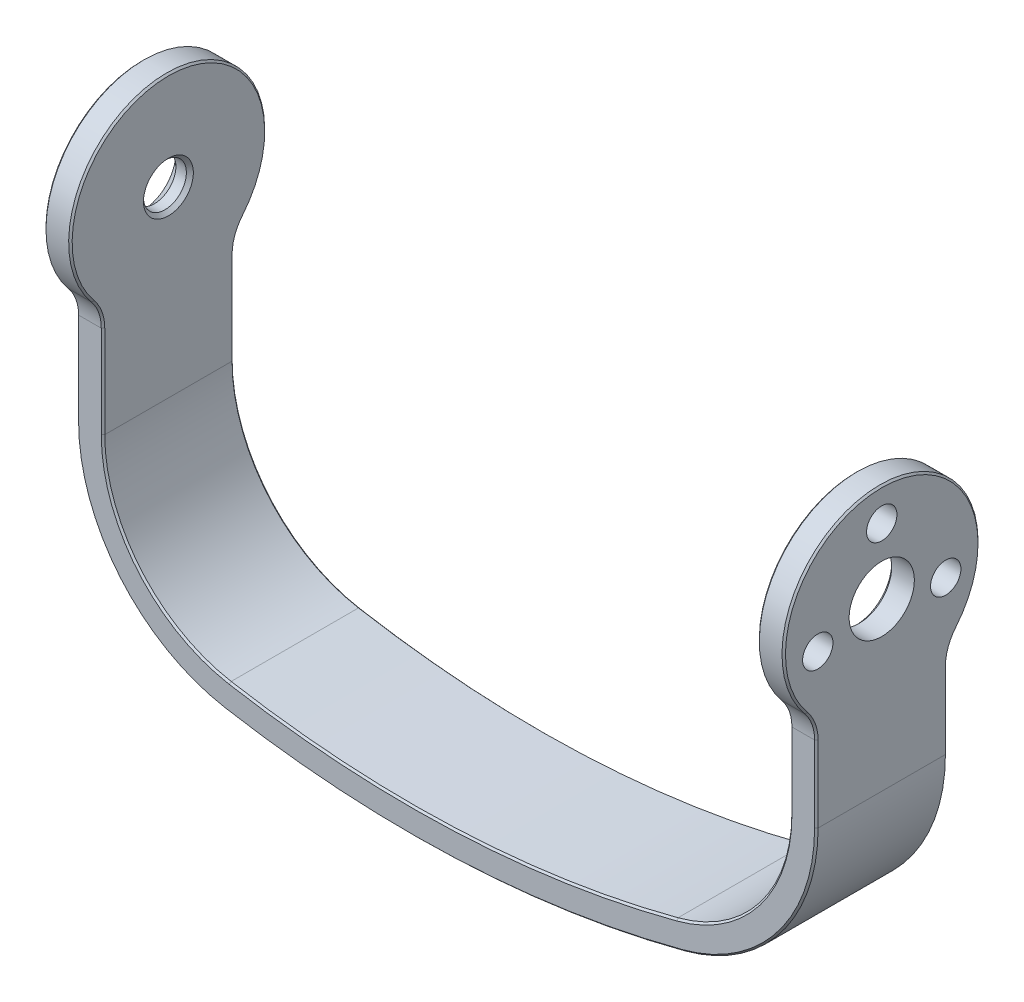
ISO-10303-21;
HEADER;
FILE_DESCRIPTION(('STEP AP214'),'2;1');
FILE_NAME('part.step','',(''),(''),'','','');
FILE_SCHEMA(('AUTOMOTIVE_DESIGN { 1 0 10303 214 1 1 1 1 }'));
ENDSEC;
DATA;
#1=APPLICATION_CONTEXT('core data for automotive mechanical design processes');
#2=APPLICATION_PROTOCOL_DEFINITION('international standard','automotive_design',2000,#1);
#3=PRODUCT_CONTEXT('',#1,'mechanical');
#4=PRODUCT('Part','Part','',(#3));
#5=PRODUCT_RELATED_PRODUCT_CATEGORY('part','',(#4));
#6=PRODUCT_DEFINITION_FORMATION('','',#4);
#7=PRODUCT_DEFINITION_CONTEXT('part definition',#1,'design');
#8=PRODUCT_DEFINITION('design','',#6,#7);
#9=PRODUCT_DEFINITION_SHAPE('','',#8);
#10=(LENGTH_UNIT() NAMED_UNIT(*) SI_UNIT(.MILLI.,.METRE.));
#11=(NAMED_UNIT(*) PLANE_ANGLE_UNIT() SI_UNIT($,.RADIAN.));
#12=(NAMED_UNIT(*) SI_UNIT($,.STERADIAN.) SOLID_ANGLE_UNIT());
#13=UNCERTAINTY_MEASURE_WITH_UNIT(LENGTH_MEASURE(1.E-05),#10,'distance_accuracy_value','');
#14=(GEOMETRIC_REPRESENTATION_CONTEXT(3) GLOBAL_UNCERTAINTY_ASSIGNED_CONTEXT((#13)) GLOBAL_UNIT_ASSIGNED_CONTEXT((#10,
#11,#12)) REPRESENTATION_CONTEXT('',''));
#15=CARTESIAN_POINT('',(0.,0.,0.));
#16=DIRECTION('',(0.,0.,1.));
#17=DIRECTION('',(1.,0.,0.));
#18=AXIS2_PLACEMENT_3D('',#15,#16,#17);
#19=CARTESIAN_POINT('',(-11.2268,-13.2990526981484,4.7625));
#20=DIRECTION('',(0.,0.,-1.));
#21=DIRECTION('',(-1.,0.,0.));
#22=AXIS2_PLACEMENT_3D('',#19,#20,#21);
#23=PLANE('',#22);
#24=DIRECTION('',(-1.,0.,0.));
#25=VECTOR('',#24,1.);
#26=CARTESIAN_POINT('',(-11.2268,-6.58344040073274,4.7625));
#27=LINE('',#26,#25);
#28=CARTESIAN_POINT('',(-22.479,-6.58344040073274,4.7625));
#29=VERTEX_POINT('',#28);
#30=CARTESIAN_POINT('',(-24.13,-6.58344040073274,4.7625));
#31=VERTEX_POINT('',#30);
#32=EDGE_CURVE('E262',#29,#31,#27,.T.);
#33=ORIENTED_EDGE('',*,*,#32,.T.);
#34=DIRECTION('',(0.,-1.,0.));
#35=VECTOR('',#34,1.);
#36=CARTESIAN_POINT('',(-24.13,-13.2990526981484,4.7625));
#37=LINE('',#36,#35);
#38=CARTESIAN_POINT('',(-24.13,-13.2990526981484,4.7625));
#39=VERTEX_POINT('',#38);
#40=EDGE_CURVE('E504',#31,#39,#37,.T.);
#41=ORIENTED_EDGE('',*,*,#40,.T.);
#42=CARTESIAN_POINT('',(-11.2268,-13.2990526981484,4.7625));
#43=DIRECTION('',(0.,0.,-1.));
#44=DIRECTION('',(-1.,0.,0.));
#45=AXIS2_PLACEMENT_3D('',#42,#43,#44);
#46=CIRCLE('',#45,12.9032);
#47=CARTESIAN_POINT('',(-13.4528790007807,-26.0087789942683,4.7625));
#48=VERTEX_POINT('',#47);
#49=EDGE_CURVE('E502',#39,#48,#46,.F.);
#50=ORIENTED_EDGE('',*,*,#49,.T.);
#51=CARTESIAN_POINT('',(0.,50.8,4.7625));
#52=DIRECTION('',(0.,0.,-1.));
#53=DIRECTION('',(-1.,0.,0.));
#54=AXIS2_PLACEMENT_3D('',#51,#52,#53);
#55=CIRCLE('',#54,77.978);
#56=CARTESIAN_POINT('',(19.8445183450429,-24.610633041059,4.7625));
#57=VERTEX_POINT('',#56);
#58=EDGE_CURVE('E500',#48,#57,#55,.F.);
#59=ORIENTED_EDGE('',*,*,#58,.T.);
#60=CARTESIAN_POINT('',(16.5608,-12.1322611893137,4.7625));
#61=DIRECTION('',(0.,0.,-1.));
#62=DIRECTION('',(-1.,0.,0.));
#63=AXIS2_PLACEMENT_3D('',#60,#61,#62);
#64=CIRCLE('',#63,12.9032);
#65=CARTESIAN_POINT('',(29.464,-12.1322611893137,4.7625));
#66=VERTEX_POINT('',#65);
#67=EDGE_CURVE('E246',#57,#66,#64,.F.);
#68=ORIENTED_EDGE('',*,*,#67,.T.);
#69=DIRECTION('',(0.,1.,0.));
#70=VECTOR('',#69,1.);
#71=CARTESIAN_POINT('',(29.464,-13.2990526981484,4.7625));
#72=LINE('',#71,#70);
#73=CARTESIAN_POINT('',(29.464,-6.58344040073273,4.7625));
#74=VERTEX_POINT('',#73);
#75=EDGE_CURVE('E240',#66,#74,#72,.T.);
#76=ORIENTED_EDGE('',*,*,#75,.T.);
#77=DIRECTION('',(1.,0.,0.));
#78=VECTOR('',#77,1.);
#79=CARTESIAN_POINT('',(27.686,-6.58344040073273,4.7625));
#80=LINE('',#79,#78);
#81=CARTESIAN_POINT('',(27.8130000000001,-6.58344040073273,4.7625));
#82=VERTEX_POINT('',#81);
#83=EDGE_CURVE('E243',#74,#82,#80,.F.);
#84=ORIENTED_EDGE('',*,*,#83,.T.);
#85=DIRECTION('',(0.,-1.,0.));
#86=VECTOR('',#85,1.);
#87=CARTESIAN_POINT('',(27.8130000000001,-13.2990526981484,4.7625));
#88=LINE('',#87,#86);
#89=CARTESIAN_POINT('',(27.8130000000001,-12.1322611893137,4.7625));
#90=VERTEX_POINT('',#89);
#91=EDGE_CURVE('E489',#82,#90,#88,.T.);
#92=ORIENTED_EDGE('',*,*,#91,.T.);
#93=CARTESIAN_POINT('',(16.5608,-12.1322611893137,4.7625));
#94=DIRECTION('',(0.,0.,-1.));
#95=DIRECTION('',(-1.,0.,0.));
#96=AXIS2_PLACEMENT_3D('',#93,#94,#95);
#97=CIRCLE('',#96,11.2522);
#98=CARTESIAN_POINT('',(19.4243575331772,-23.0139909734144,4.7625));
#99=VERTEX_POINT('',#98);
#100=EDGE_CURVE('E491',#90,#99,#97,.T.);
#101=ORIENTED_EDGE('',*,*,#100,.T.);
#102=CARTESIAN_POINT('',(0.,50.8,4.7625));
#103=DIRECTION('',(0.,0.,-1.));
#104=DIRECTION('',(-1.,0.,0.));
#105=AXIS2_PLACEMENT_3D('',#102,#103,#104);
#106=CIRCLE('',#105,76.327);
#107=CARTESIAN_POINT('',(-13.1680460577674,-24.3825344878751,4.7625));
#108=VERTEX_POINT('',#107);
#109=EDGE_CURVE('E493',#99,#108,#106,.T.);
#110=ORIENTED_EDGE('',*,*,#109,.T.);
#111=CARTESIAN_POINT('',(-11.2268,-13.2990526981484,4.7625));
#112=DIRECTION('',(0.,0.,-1.));
#113=DIRECTION('',(-1.,0.,0.));
#114=AXIS2_PLACEMENT_3D('',#111,#112,#113);
#115=CIRCLE('',#114,11.2522);
#116=CARTESIAN_POINT('',(-22.479,-13.2990526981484,4.7625));
#117=VERTEX_POINT('',#116);
#118=EDGE_CURVE('E495',#108,#117,#115,.T.);
#119=ORIENTED_EDGE('',*,*,#118,.T.);
#120=DIRECTION('',(0.,1.,0.));
#121=VECTOR('',#120,1.);
#122=CARTESIAN_POINT('',(-22.479,-13.2990526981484,4.7625));
#123=LINE('',#122,#121);
#124=EDGE_CURVE('E251',#117,#29,#123,.T.);
#125=ORIENTED_EDGE('',*,*,#124,.T.);
#126=EDGE_LOOP('',(#33,#41,#50,#59,#68,#76,#84,#92,#101,#110,#119,#125));
#127=FACE_BOUND('',#126,.T.);
#128=ADVANCED_FACE('F33',(#127),#23,.F.);
#129=CARTESIAN_POINT('',(-11.2268,-13.2990526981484,-4.7625));
#130=DIRECTION('',(0.,0.,-1.));
#131=DIRECTION('',(-1.,0.,0.));
#132=AXIS2_PLACEMENT_3D('',#129,#130,#131);
#133=PLANE('',#132);
#134=CARTESIAN_POINT('',(-11.2268,-13.2990526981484,-4.7625));
#135=DIRECTION('',(0.,0.,-1.));
#136=DIRECTION('',(-1.,0.,0.));
#137=AXIS2_PLACEMENT_3D('',#134,#135,#136);
#138=CIRCLE('',#137,12.9032);
#139=CARTESIAN_POINT('',(-13.4528790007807,-26.0087789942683,-4.7625));
#140=VERTEX_POINT('',#139);
#141=CARTESIAN_POINT('',(-24.13,-13.2990526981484,-4.7625));
#142=VERTEX_POINT('',#141);
#143=EDGE_CURVE('E408',#140,#142,#138,.T.);
#144=ORIENTED_EDGE('',*,*,#143,.T.);
#145=DIRECTION('',(0.,1.,0.));
#146=VECTOR('',#145,1.);
#147=CARTESIAN_POINT('',(-24.13,-6.58344040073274,-4.7625));
#148=LINE('',#147,#146);
#149=CARTESIAN_POINT('',(-24.13,-6.58344040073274,-4.7625));
#150=VERTEX_POINT('',#149);
#151=EDGE_CURVE('E410',#142,#150,#148,.T.);
#152=ORIENTED_EDGE('',*,*,#151,.T.);
#153=DIRECTION('',(1.,0.,0.));
#154=VECTOR('',#153,1.);
#155=CARTESIAN_POINT('',(-22.352,-6.58344040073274,-4.7625));
#156=LINE('',#155,#154);
#157=CARTESIAN_POINT('',(-22.479,-6.58344040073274,-4.7625));
#158=VERTEX_POINT('',#157);
#159=EDGE_CURVE('E479',#150,#158,#156,.T.);
#160=ORIENTED_EDGE('',*,*,#159,.T.);
#161=DIRECTION('',(0.,-1.,0.));
#162=VECTOR('',#161,1.);
#163=CARTESIAN_POINT('',(-22.479,-13.2990526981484,-4.7625));
#164=LINE('',#163,#162);
#165=CARTESIAN_POINT('',(-22.479,-13.2990526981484,-4.7625));
#166=VERTEX_POINT('',#165);
#167=EDGE_CURVE('E400',#158,#166,#164,.T.);
#168=ORIENTED_EDGE('',*,*,#167,.T.);
#169=CARTESIAN_POINT('',(-11.2268,-13.2990526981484,-4.7625));
#170=DIRECTION('',(0.,0.,-1.));
#171=DIRECTION('',(-1.,0.,0.));
#172=AXIS2_PLACEMENT_3D('',#169,#170,#171);
#173=CIRCLE('',#172,11.2522);
#174=CARTESIAN_POINT('',(-13.1680460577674,-24.3825344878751,-4.7625));
#175=VERTEX_POINT('',#174);
#176=EDGE_CURVE('E398',#166,#175,#173,.F.);
#177=ORIENTED_EDGE('',*,*,#176,.T.);
#178=CARTESIAN_POINT('',(0.,50.8,-4.7625));
#179=DIRECTION('',(0.,0.,-1.));
#180=DIRECTION('',(-1.,0.,0.));
#181=AXIS2_PLACEMENT_3D('',#178,#179,#180);
#182=CIRCLE('',#181,76.327);
#183=CARTESIAN_POINT('',(19.4243575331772,-23.0139909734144,-4.7625));
#184=VERTEX_POINT('',#183);
#185=EDGE_CURVE('E389',#175,#184,#182,.F.);
#186=ORIENTED_EDGE('',*,*,#185,.T.);
#187=CARTESIAN_POINT('',(16.5608,-12.1322611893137,-4.7625));
#188=DIRECTION('',(0.,0.,-1.));
#189=DIRECTION('',(-1.,0.,0.));
#190=AXIS2_PLACEMENT_3D('',#187,#188,#189);
#191=CIRCLE('',#190,11.2522);
#192=CARTESIAN_POINT('',(27.813,-12.1322611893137,-4.7625));
#193=VERTEX_POINT('',#192);
#194=EDGE_CURVE('E386',#184,#193,#191,.F.);
#195=ORIENTED_EDGE('',*,*,#194,.T.);
#196=DIRECTION('',(0.,1.,0.));
#197=VECTOR('',#196,1.);
#198=CARTESIAN_POINT('',(27.8130000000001,-6.58344040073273,-4.7625));
#199=LINE('',#198,#197);
#200=CARTESIAN_POINT('',(27.8130000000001,-6.58344040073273,-4.7625));
#201=VERTEX_POINT('',#200);
#202=EDGE_CURVE('E396',#193,#201,#199,.T.);
#203=ORIENTED_EDGE('',*,*,#202,.T.);
#204=DIRECTION('',(-1.,0.,0.));
#205=VECTOR('',#204,1.);
#206=CARTESIAN_POINT('',(-11.2268,-6.58344040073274,-4.7625));
#207=LINE('',#206,#205);
#208=CARTESIAN_POINT('',(29.464,-6.58344040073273,-4.7625));
#209=VERTEX_POINT('',#208);
#210=EDGE_CURVE('E475',#201,#209,#207,.F.);
#211=ORIENTED_EDGE('',*,*,#210,.T.);
#212=DIRECTION('',(0.,-1.,0.));
#213=VECTOR('',#212,1.);
#214=CARTESIAN_POINT('',(29.464,-12.1322611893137,-4.7625));
#215=LINE('',#214,#213);
#216=CARTESIAN_POINT('',(29.464,-12.1322611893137,-4.7625));
#217=VERTEX_POINT('',#216);
#218=EDGE_CURVE('E402',#209,#217,#215,.T.);
#219=ORIENTED_EDGE('',*,*,#218,.T.);
#220=CARTESIAN_POINT('',(16.5608,-12.1322611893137,-4.7625));
#221=DIRECTION('',(0.,0.,-1.));
#222=DIRECTION('',(-1.,0.,0.));
#223=AXIS2_PLACEMENT_3D('',#220,#221,#222);
#224=CIRCLE('',#223,12.9032);
#225=CARTESIAN_POINT('',(19.8445183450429,-24.610633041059,-4.7625));
#226=VERTEX_POINT('',#225);
#227=EDGE_CURVE('E404',#217,#226,#224,.T.);
#228=ORIENTED_EDGE('',*,*,#227,.T.);
#229=CARTESIAN_POINT('',(0.,50.8,-4.7625));
#230=DIRECTION('',(0.,0.,-1.));
#231=DIRECTION('',(-1.,0.,0.));
#232=AXIS2_PLACEMENT_3D('',#229,#230,#231);
#233=CIRCLE('',#232,77.978);
#234=EDGE_CURVE('E406',#226,#140,#233,.T.);
#235=ORIENTED_EDGE('',*,*,#234,.T.);
#236=EDGE_LOOP('',(#144,#152,#160,#168,#177,#186,#195,#203,#211,#219,#228,#235));
#237=FACE_BOUND('',#236,.T.);
#238=ADVANCED_FACE('F586',(#237),#133,.T.);
#239=CARTESIAN_POINT('',(-24.257,0.,4.7625));
#240=DIRECTION('',(1.,0.,0.));
#241=DIRECTION('',(0.,1.,0.));
#242=AXIS2_PLACEMENT_3D('',#239,#240,#241);
#243=PLANE('',#242);
#244=CARTESIAN_POINT('',(-24.257,0.,0.));
#245=DIRECTION('',(1.,0.,0.));
#246=DIRECTION('',(0.,1.,0.));
#247=AXIS2_PLACEMENT_3D('',#244,#245,#246);
#248=CIRCLE('',#247,2.45109999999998);
#249=CARTESIAN_POINT('',(-24.257,2.45109999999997,0.));
#250=VERTEX_POINT('',#249);
#251=EDGE_CURVE('E589',#250,#250,#248,.T.);
#252=ORIENTED_EDGE('',*,*,#251,.T.);
#253=EDGE_LOOP('',(#252));
#254=FACE_BOUND('',#253,.T.);
#255=DIRECTION('',(0.,0.,-1.));
#256=VECTOR('',#255,1.);
#257=CARTESIAN_POINT('',(-24.257,-13.2990526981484,4.7625));
#258=LINE('',#257,#256);
#259=CARTESIAN_POINT('',(-24.257,-13.2990526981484,4.6355));
#260=VERTEX_POINT('',#259);
#261=CARTESIAN_POINT('',(-24.257,-13.2990526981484,-4.6355));
#262=VERTEX_POINT('',#261);
#263=EDGE_CURVE('E631',#260,#262,#258,.T.);
#264=ORIENTED_EDGE('',*,*,#263,.F.);
#265=DIRECTION('',(0.,1.,0.));
#266=VECTOR('',#265,1.);
#267=CARTESIAN_POINT('',(-24.257,0.,4.6355));
#268=LINE('',#267,#266);
#269=CARTESIAN_POINT('',(-24.257,-6.58344040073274,4.6355));
#270=VERTEX_POINT('',#269);
#271=EDGE_CURVE('E515',#260,#270,#268,.T.);
#272=ORIENTED_EDGE('',*,*,#271,.T.);
#273=CARTESIAN_POINT('',(-24.257,-6.58344040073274,7.9375));
#274=DIRECTION('',(1.,0.,0.));
#275=DIRECTION('',(0.,1.,0.));
#276=AXIS2_PLACEMENT_3D('',#273,#274,#275);
#277=CIRCLE('',#276,3.302);
#278=CARTESIAN_POINT('',(-24.257,-4.47544224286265,5.39593596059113));
#279=VERTEX_POINT('',#278);
#280=EDGE_CURVE('E513',#270,#279,#277,.T.);
#281=ORIENTED_EDGE('',*,*,#280,.T.);
#282=CARTESIAN_POINT('',(-24.257,0.,0.));
#283=DIRECTION('',(1.,0.,0.));
#284=DIRECTION('',(0.,1.,0.));
#285=AXIS2_PLACEMENT_3D('',#282,#283,#284);
#286=CIRCLE('',#285,7.0104);
#287=CARTESIAN_POINT('',(-24.257,-4.47544224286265,-5.39593596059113));
#288=VERTEX_POINT('',#287);
#289=EDGE_CURVE('E511',#279,#288,#286,.F.);
#290=ORIENTED_EDGE('',*,*,#289,.T.);
#291=CARTESIAN_POINT('',(-24.257,-6.58344040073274,-7.9375));
#292=DIRECTION('',(1.,0.,0.));
#293=DIRECTION('',(0.,1.,0.));
#294=AXIS2_PLACEMENT_3D('',#291,#292,#293);
#295=CIRCLE('',#294,3.302);
#296=CARTESIAN_POINT('',(-24.257,-6.58344040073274,-4.6355));
#297=VERTEX_POINT('',#296);
#298=EDGE_CURVE('E509',#288,#297,#295,.T.);
#299=ORIENTED_EDGE('',*,*,#298,.T.);
#300=DIRECTION('',(0.,-1.,0.));
#301=VECTOR('',#300,1.);
#302=CARTESIAN_POINT('',(-24.257,-13.2990526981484,-4.6355));
#303=LINE('',#302,#301);
#304=EDGE_CURVE('E507',#297,#262,#303,.T.);
#305=ORIENTED_EDGE('',*,*,#304,.T.);
#306=EDGE_LOOP('',(#264,#272,#281,#290,#299,#305));
#307=FACE_BOUND('',#306,.T.);
#308=ADVANCED_FACE('F652',(#254,#307),#243,.F.);
#309=CARTESIAN_POINT('',(-11.2268,-13.2990526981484,4.7625));
#310=DIRECTION('',(0.,0.,-1.));
#311=DIRECTION('',(-1.,0.,0.));
#312=AXIS2_PLACEMENT_3D('',#309,#310,#311);
#313=CYLINDRICAL_SURFACE('',#312,13.0302);
#314=DIRECTION('',(0.,0.,-1.));
#315=VECTOR('',#314,1.);
#316=CARTESIAN_POINT('',(-13.4747892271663,-26.1338747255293,4.7625));
#317=LINE('',#316,#315);
#318=CARTESIAN_POINT('',(-13.4747892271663,-26.1338747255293,4.6355));
#319=VERTEX_POINT('',#318);
#320=CARTESIAN_POINT('',(-13.4747892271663,-26.1338747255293,-4.6355));
#321=VERTEX_POINT('',#320);
#322=EDGE_CURVE('E628',#319,#321,#317,.T.);
#323=ORIENTED_EDGE('',*,*,#322,.F.);
#324=CARTESIAN_POINT('',(-11.2268,-13.2990526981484,4.6355));
#325=DIRECTION('',(0.,0.,-1.));
#326=DIRECTION('',(-1.,0.,0.));
#327=AXIS2_PLACEMENT_3D('',#324,#325,#326);
#328=CIRCLE('',#327,13.0302);
#329=EDGE_CURVE('E524',#319,#260,#328,.T.);
#330=ORIENTED_EDGE('',*,*,#329,.T.);
#331=ORIENTED_EDGE('',*,*,#263,.T.);
#332=CARTESIAN_POINT('',(-11.2268,-13.2990526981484,-4.6355));
#333=DIRECTION('',(0.,0.,-1.));
#334=DIRECTION('',(-1.,0.,0.));
#335=AXIS2_PLACEMENT_3D('',#332,#333,#334);
#336=CIRCLE('',#335,13.0302);
#337=EDGE_CURVE('E522',#262,#321,#336,.F.);
#338=ORIENTED_EDGE('',*,*,#337,.T.);
#339=EDGE_LOOP('',(#323,#330,#331,#338));
#340=FACE_BOUND('',#339,.T.);
#341=ADVANCED_FACE('F715',(#340),#313,.T.);
#342=CARTESIAN_POINT('',(0.,50.8,4.7625));
#343=DIRECTION('',(0.,0.,-1.));
#344=DIRECTION('',(-1.,0.,0.));
#345=AXIS2_PLACEMENT_3D('',#342,#343,#344);
#346=CYLINDRICAL_SURFACE('',#345,78.105);
#347=DIRECTION('',(0.,0.,-1.));
#348=VECTOR('',#347,1.);
#349=CARTESIAN_POINT('',(19.8768384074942,-24.733451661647,4.7625));
#350=LINE('',#349,#348);
#351=CARTESIAN_POINT('',(19.8768384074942,-24.733451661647,4.6355));
#352=VERTEX_POINT('',#351);
#353=CARTESIAN_POINT('',(19.8768384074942,-24.733451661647,-4.6355));
#354=VERTEX_POINT('',#353);
#355=EDGE_CURVE('E626',#352,#354,#350,.T.);
#356=ORIENTED_EDGE('',*,*,#355,.F.);
#357=CARTESIAN_POINT('',(0.,50.8,4.6355));
#358=DIRECTION('',(0.,0.,-1.));
#359=DIRECTION('',(-1.,0.,0.));
#360=AXIS2_PLACEMENT_3D('',#357,#358,#359);
#361=CIRCLE('',#360,78.105);
#362=EDGE_CURVE('E532',#352,#319,#361,.T.);
#363=ORIENTED_EDGE('',*,*,#362,.T.);
#364=ORIENTED_EDGE('',*,*,#322,.T.);
#365=CARTESIAN_POINT('',(0.,50.8,-4.6355));
#366=DIRECTION('',(0.,0.,-1.));
#367=DIRECTION('',(-1.,0.,0.));
#368=AXIS2_PLACEMENT_3D('',#365,#366,#367);
#369=CIRCLE('',#368,78.105);
#370=EDGE_CURVE('E530',#321,#354,#369,.F.);
#371=ORIENTED_EDGE('',*,*,#370,.T.);
#372=EDGE_LOOP('',(#356,#363,#364,#371));
#373=FACE_BOUND('',#372,.T.);
#374=ADVANCED_FACE('F712',(#373),#346,.T.);
#375=CARTESIAN_POINT('',(16.5608,-12.1322611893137,4.7625));
#376=DIRECTION('',(0.,0.,-1.));
#377=DIRECTION('',(-1.,0.,0.));
#378=AXIS2_PLACEMENT_3D('',#375,#376,#377);
#379=CYLINDRICAL_SURFACE('',#378,13.0302);
#380=DIRECTION('',(0.,0.,-1.));
#381=VECTOR('',#380,1.);
#382=CARTESIAN_POINT('',(29.591,-12.1322611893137,4.7625));
#383=LINE('',#382,#381);
#384=CARTESIAN_POINT('',(29.591,-12.1322611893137,4.6355));
#385=VERTEX_POINT('',#384);
#386=CARTESIAN_POINT('',(29.591,-12.1322611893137,-4.6355));
#387=VERTEX_POINT('',#386);
#388=EDGE_CURVE('E623',#385,#387,#383,.T.);
#389=ORIENTED_EDGE('',*,*,#388,.F.);
#390=CARTESIAN_POINT('',(16.5608,-12.1322611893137,4.6355));
#391=DIRECTION('',(0.,0.,-1.));
#392=DIRECTION('',(-1.,0.,0.));
#393=AXIS2_PLACEMENT_3D('',#390,#391,#392);
#394=CIRCLE('',#393,13.0302);
#395=EDGE_CURVE('E380',#385,#352,#394,.T.);
#396=ORIENTED_EDGE('',*,*,#395,.T.);
#397=ORIENTED_EDGE('',*,*,#355,.T.);
#398=CARTESIAN_POINT('',(16.5608,-12.1322611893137,-4.6355));
#399=DIRECTION('',(0.,0.,-1.));
#400=DIRECTION('',(-1.,0.,0.));
#401=AXIS2_PLACEMENT_3D('',#398,#399,#400);
#402=CIRCLE('',#401,13.0302);
#403=EDGE_CURVE('E387',#354,#387,#402,.F.);
#404=ORIENTED_EDGE('',*,*,#403,.T.);
#405=EDGE_LOOP('',(#389,#396,#397,#404));
#406=FACE_BOUND('',#405,.T.);
#407=ADVANCED_FACE('F708',(#406),#379,.T.);
#408=CARTESIAN_POINT('',(29.591,0.,4.7625));
#409=DIRECTION('',(-1.,0.,0.));
#410=DIRECTION('',(0.,0.,1.));
#411=AXIS2_PLACEMENT_3D('',#408,#409,#410);
#412=PLANE('',#411);
#413=CARTESIAN_POINT('',(29.591,-0.990179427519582,-4.65842794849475));
#414=DIRECTION('',(1.,0.,0.));
#415=DIRECTION('',(0.,0.,-1.));
#416=AXIS2_PLACEMENT_3D('',#413,#414,#415);
#417=CIRCLE('',#416,1.1049);
#418=CARTESIAN_POINT('',(29.591,-0.990179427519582,-5.76332794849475));
#419=VERTEX_POINT('',#418);
#420=EDGE_CURVE('E303',#419,#419,#417,.T.);
#421=ORIENTED_EDGE('',*,*,#420,.F.);
#422=EDGE_LOOP('',(#421));
#423=FACE_BOUND('',#422,.T.);
#424=CARTESIAN_POINT('',(29.591,-0.990179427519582,4.65842794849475));
#425=DIRECTION('',(1.,0.,0.));
#426=DIRECTION('',(0.,0.,-1.));
#427=AXIS2_PLACEMENT_3D('',#424,#425,#426);
#428=CIRCLE('',#427,1.1049);
#429=CARTESIAN_POINT('',(29.591,-0.990179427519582,3.55352794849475));
#430=VERTEX_POINT('',#429);
#431=EDGE_CURVE('E1236',#430,#430,#428,.T.);
#432=ORIENTED_EDGE('',*,*,#431,.F.);
#433=EDGE_LOOP('',(#432));
#434=FACE_BOUND('',#433,.T.);
#435=CARTESIAN_POINT('',(29.591,4.7625,0.));
#436=DIRECTION('',(1.,0.,0.));
#437=DIRECTION('',(0.,0.,-1.));
#438=AXIS2_PLACEMENT_3D('',#435,#436,#437);
#439=CIRCLE('',#438,1.1049);
#440=CARTESIAN_POINT('',(29.591,4.7625,-1.1049));
#441=VERTEX_POINT('',#440);
#442=EDGE_CURVE('E1248',#441,#441,#439,.T.);
#443=ORIENTED_EDGE('',*,*,#442,.F.);
#444=EDGE_LOOP('',(#443));
#445=FACE_BOUND('',#444,.T.);
#446=CARTESIAN_POINT('',(29.591,0.,0.));
#447=DIRECTION('',(1.,0.,0.));
#448=DIRECTION('',(0.,0.,-1.));
#449=AXIS2_PLACEMENT_3D('',#446,#447,#448);
#450=CIRCLE('',#449,2.3749);
#451=CARTESIAN_POINT('',(29.591,0.,-2.3749));
#452=VERTEX_POINT('',#451);
#453=EDGE_CURVE('E617',#452,#452,#450,.T.);
#454=ORIENTED_EDGE('',*,*,#453,.F.);
#455=EDGE_LOOP('',(#454));
#456=FACE_BOUND('',#455,.T.);
#457=CARTESIAN_POINT('',(29.591,-6.58344040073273,7.9375));
#458=DIRECTION('',(-1.,0.,0.));
#459=DIRECTION('',(0.,0.,1.));
#460=AXIS2_PLACEMENT_3D('',#457,#458,#459);
#461=CIRCLE('',#460,3.302);
#462=CARTESIAN_POINT('',(29.591,-4.47544224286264,5.39593596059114));
#463=VERTEX_POINT('',#462);
#464=CARTESIAN_POINT('',(29.591,-6.58344040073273,4.6355));
#465=VERTEX_POINT('',#464);
#466=EDGE_CURVE('E418',#463,#465,#461,.T.);
#467=ORIENTED_EDGE('',*,*,#466,.T.);
#468=DIRECTION('',(0.,-1.,0.));
#469=VECTOR('',#468,1.);
#470=CARTESIAN_POINT('',(29.591,0.,4.6355));
#471=LINE('',#470,#469);
#472=EDGE_CURVE('E276',#465,#385,#471,.T.);
#473=ORIENTED_EDGE('',*,*,#472,.T.);
#474=ORIENTED_EDGE('',*,*,#388,.T.);
#475=DIRECTION('',(0.,1.,0.));
#476=VECTOR('',#475,1.);
#477=CARTESIAN_POINT('',(29.591,-6.58344040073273,-4.6355));
#478=LINE('',#477,#476);
#479=CARTESIAN_POINT('',(29.591,-6.58344040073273,-4.6355));
#480=VERTEX_POINT('',#479);
#481=EDGE_CURVE('E412',#387,#480,#478,.T.);
#482=ORIENTED_EDGE('',*,*,#481,.T.);
#483=CARTESIAN_POINT('',(29.591,-6.58344040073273,-7.9375));
#484=DIRECTION('',(-1.,0.,0.));
#485=DIRECTION('',(0.,0.,1.));
#486=AXIS2_PLACEMENT_3D('',#483,#484,#485);
#487=CIRCLE('',#486,3.302);
#488=CARTESIAN_POINT('',(29.591,-4.47544224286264,-5.39593596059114));
#489=VERTEX_POINT('',#488);
#490=EDGE_CURVE('E414',#480,#489,#487,.T.);
#491=ORIENTED_EDGE('',*,*,#490,.T.);
#492=CARTESIAN_POINT('',(29.591,0.,0.));
#493=DIRECTION('',(-1.,0.,0.));
#494=DIRECTION('',(0.,0.,1.));
#495=AXIS2_PLACEMENT_3D('',#492,#493,#494);
#496=CIRCLE('',#495,7.01040000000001);
#497=EDGE_CURVE('E416',#489,#463,#496,.F.);
#498=ORIENTED_EDGE('',*,*,#497,.T.);
#499=EDGE_LOOP('',(#467,#473,#474,#482,#491,#498));
#500=FACE_BOUND('',#499,.T.);
#501=ADVANCED_FACE('F704',(#423,#434,#445,#456,#500),#412,.F.);
#502=CARTESIAN_POINT('',(27.686,0.,4.7625));
#503=DIRECTION('',(1.,0.,0.));
#504=DIRECTION('',(0.,0.,-1.));
#505=AXIS2_PLACEMENT_3D('',#502,#503,#504);
#506=PLANE('',#505);
#507=CARTESIAN_POINT('',(27.686,0.,0.));
#508=DIRECTION('',(1.,0.,0.));
#509=DIRECTION('',(0.,0.,-1.));
#510=AXIS2_PLACEMENT_3D('',#507,#508,#509);
#511=CIRCLE('',#510,2.62889999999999);
#512=CARTESIAN_POINT('',(27.686,0.,-2.62889999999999));
#513=VERTEX_POINT('',#512);
#514=EDGE_CURVE('E637',#513,#513,#511,.T.);
#515=ORIENTED_EDGE('',*,*,#514,.T.);
#516=EDGE_LOOP('',(#515));
#517=FACE_BOUND('',#516,.T.);
#518=CARTESIAN_POINT('',(27.686,-0.990179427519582,-4.65842794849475));
#519=DIRECTION('',(1.,0.,0.));
#520=DIRECTION('',(0.,0.,-1.));
#521=AXIS2_PLACEMENT_3D('',#518,#519,#520);
#522=CIRCLE('',#521,1.1049);
#523=CARTESIAN_POINT('',(27.686,-0.990179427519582,-5.76332794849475));
#524=VERTEX_POINT('',#523);
#525=EDGE_CURVE('E1234',#524,#524,#522,.F.);
#526=ORIENTED_EDGE('',*,*,#525,.F.);
#527=EDGE_LOOP('',(#526));
#528=FACE_BOUND('',#527,.T.);
#529=CARTESIAN_POINT('',(27.686,-0.990179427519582,4.65842794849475));
#530=DIRECTION('',(1.,0.,0.));
#531=DIRECTION('',(0.,0.,-1.));
#532=AXIS2_PLACEMENT_3D('',#529,#530,#531);
#533=CIRCLE('',#532,1.1049);
#534=CARTESIAN_POINT('',(27.686,-0.990179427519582,3.55352794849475));
#535=VERTEX_POINT('',#534);
#536=EDGE_CURVE('E1239',#535,#535,#533,.F.);
#537=ORIENTED_EDGE('',*,*,#536,.F.);
#538=EDGE_LOOP('',(#537));
#539=FACE_BOUND('',#538,.T.);
#540=CARTESIAN_POINT('',(27.686,4.7625,0.));
#541=DIRECTION('',(1.,0.,0.));
#542=DIRECTION('',(0.,0.,-1.));
#543=AXIS2_PLACEMENT_3D('',#540,#541,#542);
#544=CIRCLE('',#543,1.1049);
#545=CARTESIAN_POINT('',(27.686,4.7625,-1.1049));
#546=VERTEX_POINT('',#545);
#547=EDGE_CURVE('E1244',#546,#546,#544,.F.);
#548=ORIENTED_EDGE('',*,*,#547,.F.);
#549=EDGE_LOOP('',(#548));
#550=FACE_BOUND('',#549,.T.);
#551=DIRECTION('',(0.,0.,-1.));
#552=VECTOR('',#551,1.);
#553=CARTESIAN_POINT('',(27.686,-12.1322611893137,4.7625));
#554=LINE('',#553,#552);
#555=CARTESIAN_POINT('',(27.686,-12.1322611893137,4.63549999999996));
#556=VERTEX_POINT('',#555);
#557=CARTESIAN_POINT('',(27.686,-12.1322611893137,-4.63549999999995));
#558=VERTEX_POINT('',#557);
#559=EDGE_CURVE('E615',#556,#558,#554,.T.);
#560=ORIENTED_EDGE('',*,*,#559,.F.);
#561=DIRECTION('',(0.,1.,0.));
#562=VECTOR('',#561,1.);
#563=CARTESIAN_POINT('',(27.686,0.,4.63549999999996));
#564=LINE('',#563,#562);
#565=CARTESIAN_POINT('',(27.686,-6.58344040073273,4.63549999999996));
#566=VERTEX_POINT('',#565);
#567=EDGE_CURVE('E11',#556,#566,#564,.T.);
#568=ORIENTED_EDGE('',*,*,#567,.T.);
#569=CARTESIAN_POINT('',(27.686,-6.58344040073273,7.9375));
#570=DIRECTION('',(1.,0.,0.));
#571=DIRECTION('',(0.,0.,-1.));
#572=AXIS2_PLACEMENT_3D('',#569,#570,#571);
#573=CIRCLE('',#572,3.30200000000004);
#574=CARTESIAN_POINT('',(27.686,-4.47544224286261,5.3959359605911));
#575=VERTEX_POINT('',#574);
#576=EDGE_CURVE('E42',#566,#575,#573,.T.);
#577=ORIENTED_EDGE('',*,*,#576,.T.);
#578=CARTESIAN_POINT('',(27.686,0.,0.));
#579=DIRECTION('',(1.,0.,0.));
#580=DIRECTION('',(0.,0.,-1.));
#581=AXIS2_PLACEMENT_3D('',#578,#579,#580);
#582=CIRCLE('',#581,7.01039999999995);
#583=CARTESIAN_POINT('',(27.686,-4.47544224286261,-5.3959359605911));
#584=VERTEX_POINT('',#583);
#585=EDGE_CURVE('E456',#575,#584,#582,.F.);
#586=ORIENTED_EDGE('',*,*,#585,.T.);
#587=CARTESIAN_POINT('',(27.686,-6.58344040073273,-7.9375));
#588=DIRECTION('',(1.,0.,0.));
#589=DIRECTION('',(0.,0.,-1.));
#590=AXIS2_PLACEMENT_3D('',#587,#588,#589);
#591=CIRCLE('',#590,3.30200000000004);
#592=CARTESIAN_POINT('',(27.686,-6.58344040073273,-4.63549999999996));
#593=VERTEX_POINT('',#592);
#594=EDGE_CURVE('E454',#584,#593,#591,.T.);
#595=ORIENTED_EDGE('',*,*,#594,.T.);
#596=DIRECTION('',(0.,-1.,0.));
#597=VECTOR('',#596,1.);
#598=CARTESIAN_POINT('',(27.686,-12.1322611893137,-4.63549999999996));
#599=LINE('',#598,#597);
#600=EDGE_CURVE('E452',#593,#558,#599,.T.);
#601=ORIENTED_EDGE('',*,*,#600,.T.);
#602=EDGE_LOOP('',(#560,#568,#577,#586,#595,#601));
#603=FACE_BOUND('',#602,.T.);
#604=ADVANCED_FACE('F458',(#517,#528,#539,#550,#603),#506,.F.);
#605=CARTESIAN_POINT('',(16.5608,-12.1322611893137,4.7625));
#606=DIRECTION('',(0.,0.,-1.));
#607=DIRECTION('',(-1.,0.,0.));
#608=AXIS2_PLACEMENT_3D('',#605,#606,#607);
#609=CYLINDRICAL_SURFACE('',#608,11.1252);
#610=DIRECTION('',(0.,0.,-1.));
#611=VECTOR('',#610,1.);
#612=CARTESIAN_POINT('',(19.392037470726,-22.8911723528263,4.7625));
#613=LINE('',#612,#611);
#614=CARTESIAN_POINT('',(19.392037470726,-22.8911723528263,4.63549999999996));
#615=VERTEX_POINT('',#614);
#616=CARTESIAN_POINT('',(19.392037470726,-22.8911723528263,-4.63549999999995));
#617=VERTEX_POINT('',#616);
#618=EDGE_CURVE('E607',#615,#617,#613,.T.);
#619=ORIENTED_EDGE('',*,*,#618,.F.);
#620=CARTESIAN_POINT('',(16.5608,-12.1322611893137,4.63549999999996));
#621=DIRECTION('',(0.,0.,-1.));
#622=DIRECTION('',(-1.,0.,0.));
#623=AXIS2_PLACEMENT_3D('',#620,#621,#622);
#624=CIRCLE('',#623,11.1252);
#625=EDGE_CURVE('E450',#615,#556,#624,.F.);
#626=ORIENTED_EDGE('',*,*,#625,.T.);
#627=ORIENTED_EDGE('',*,*,#559,.T.);
#628=CARTESIAN_POINT('',(16.5608,-12.1322611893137,-4.63549999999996));
#629=DIRECTION('',(0.,0.,-1.));
#630=DIRECTION('',(-1.,0.,0.));
#631=AXIS2_PLACEMENT_3D('',#628,#629,#630);
#632=CIRCLE('',#631,11.1252);
#633=EDGE_CURVE('E448',#558,#617,#632,.T.);
#634=ORIENTED_EDGE('',*,*,#633,.T.);
#635=EDGE_LOOP('',(#619,#626,#627,#634));
#636=FACE_BOUND('',#635,.T.);
#637=ADVANCED_FACE('F698',(#636),#609,.F.);
#638=CARTESIAN_POINT('',(0.,50.8,4.7625));
#639=DIRECTION('',(0.,0.,-1.));
#640=DIRECTION('',(-1.,0.,0.));
#641=AXIS2_PLACEMENT_3D('',#638,#639,#640);
#642=CYLINDRICAL_SURFACE('',#641,76.2);
#643=DIRECTION('',(0.,0.,-1.));
#644=VECTOR('',#643,1.);
#645=CARTESIAN_POINT('',(-13.1461358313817,-24.257438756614,4.7625));
#646=LINE('',#645,#644);
#647=CARTESIAN_POINT('',(-13.1461358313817,-24.257438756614,4.63549999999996));
#648=VERTEX_POINT('',#647);
#649=CARTESIAN_POINT('',(-13.1461358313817,-24.257438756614,-4.63549999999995));
#650=VERTEX_POINT('',#649);
#651=EDGE_CURVE('E605',#648,#650,#646,.T.);
#652=ORIENTED_EDGE('',*,*,#651,.F.);
#653=CARTESIAN_POINT('',(0.,50.8,4.63549999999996));
#654=DIRECTION('',(0.,0.,-1.));
#655=DIRECTION('',(-1.,0.,0.));
#656=AXIS2_PLACEMENT_3D('',#653,#654,#655);
#657=CIRCLE('',#656,76.2);
#658=EDGE_CURVE('E436',#648,#615,#657,.F.);
#659=ORIENTED_EDGE('',*,*,#658,.T.);
#660=ORIENTED_EDGE('',*,*,#618,.T.);
#661=CARTESIAN_POINT('',(0.,50.8,-4.63549999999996));
#662=DIRECTION('',(0.,0.,-1.));
#663=DIRECTION('',(-1.,0.,0.));
#664=AXIS2_PLACEMENT_3D('',#661,#662,#663);
#665=CIRCLE('',#664,76.2);
#666=EDGE_CURVE('E434',#617,#650,#665,.T.);
#667=ORIENTED_EDGE('',*,*,#666,.T.);
#668=EDGE_LOOP('',(#652,#659,#660,#667));
#669=FACE_BOUND('',#668,.T.);
#670=ADVANCED_FACE('F604',(#669),#642,.F.);
#671=CARTESIAN_POINT('',(-11.2268,-13.2990526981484,4.7625));
#672=DIRECTION('',(0.,0.,-1.));
#673=DIRECTION('',(-1.,0.,0.));
#674=AXIS2_PLACEMENT_3D('',#671,#672,#673);
#675=CYLINDRICAL_SURFACE('',#674,11.1252);
#676=DIRECTION('',(0.,0.,-1.));
#677=VECTOR('',#676,1.);
#678=CARTESIAN_POINT('',(-22.352,-13.2990526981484,4.7625));
#679=LINE('',#678,#677);
#680=CARTESIAN_POINT('',(-22.352,-13.2990526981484,4.63549999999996));
#681=VERTEX_POINT('',#680);
#682=CARTESIAN_POINT('',(-22.352,-13.2990526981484,-4.63549999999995));
#683=VERTEX_POINT('',#682);
#684=EDGE_CURVE('E613',#681,#683,#679,.T.);
#685=ORIENTED_EDGE('',*,*,#684,.F.);
#686=CARTESIAN_POINT('',(-11.2268,-13.2990526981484,4.63549999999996));
#687=DIRECTION('',(0.,0.,-1.));
#688=DIRECTION('',(-1.,0.,0.));
#689=AXIS2_PLACEMENT_3D('',#686,#687,#688);
#690=CIRCLE('',#689,11.1252);
#691=EDGE_CURVE('E431',#681,#648,#690,.F.);
#692=ORIENTED_EDGE('',*,*,#691,.T.);
#693=ORIENTED_EDGE('',*,*,#651,.T.);
#694=CARTESIAN_POINT('',(-11.2268,-13.2990526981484,-4.63549999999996));
#695=DIRECTION('',(0.,0.,-1.));
#696=DIRECTION('',(-1.,0.,0.));
#697=AXIS2_PLACEMENT_3D('',#694,#695,#696);
#698=CIRCLE('',#697,11.1252);
#699=EDGE_CURVE('E429',#650,#683,#698,.T.);
#700=ORIENTED_EDGE('',*,*,#699,.T.);
#701=EDGE_LOOP('',(#685,#692,#693,#700));
#702=FACE_BOUND('',#701,.T.);
#703=ADVANCED_FACE('F610',(#702),#675,.F.);
#704=CARTESIAN_POINT('',(-22.352,0.,4.7625));
#705=DIRECTION('',(-1.,0.,0.));
#706=DIRECTION('',(0.,0.,1.));
#707=AXIS2_PLACEMENT_3D('',#704,#705,#706);
#708=PLANE('',#707);
#709=CARTESIAN_POINT('',(-22.352,0.,0.));
#710=DIRECTION('',(-1.,0.,0.));
#711=DIRECTION('',(0.,0.,1.));
#712=AXIS2_PLACEMENT_3D('',#709,#710,#711);
#713=CIRCLE('',#712,1.81610000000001);
#714=CARTESIAN_POINT('',(-22.352,0.,1.81610000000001));
#715=VERTEX_POINT('',#714);
#716=EDGE_CURVE('E643',#715,#715,#713,.T.);
#717=ORIENTED_EDGE('',*,*,#716,.T.);
#718=EDGE_LOOP('',(#717));
#719=FACE_BOUND('',#718,.T.);
#720=CARTESIAN_POINT('',(-22.352,-6.58344040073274,7.9375));
#721=DIRECTION('',(-1.,0.,0.));
#722=DIRECTION('',(0.,0.,1.));
#723=AXIS2_PLACEMENT_3D('',#720,#721,#722);
#724=CIRCLE('',#723,3.30200000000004);
#725=CARTESIAN_POINT('',(-22.352,-4.47544224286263,5.3959359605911));
#726=VERTEX_POINT('',#725);
#727=CARTESIAN_POINT('',(-22.352,-6.58344040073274,4.63549999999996));
#728=VERTEX_POINT('',#727);
#729=EDGE_CURVE('E444',#726,#728,#724,.T.);
#730=ORIENTED_EDGE('',*,*,#729,.T.);
#731=DIRECTION('',(0.,-1.,0.));
#732=VECTOR('',#731,1.);
#733=CARTESIAN_POINT('',(-22.352,0.,4.63549999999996));
#734=LINE('',#733,#732);
#735=EDGE_CURVE('E446',#728,#681,#734,.T.);
#736=ORIENTED_EDGE('',*,*,#735,.T.);
#737=ORIENTED_EDGE('',*,*,#684,.T.);
#738=DIRECTION('',(0.,1.,0.));
#739=VECTOR('',#738,1.);
#740=CARTESIAN_POINT('',(-22.352,-6.58344040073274,-4.63549999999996));
#741=LINE('',#740,#739);
#742=CARTESIAN_POINT('',(-22.352,-6.58344040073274,-4.63549999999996));
#743=VERTEX_POINT('',#742);
#744=EDGE_CURVE('E438',#683,#743,#741,.T.);
#745=ORIENTED_EDGE('',*,*,#744,.T.);
#746=CARTESIAN_POINT('',(-22.352,-6.58344040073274,-7.9375));
#747=DIRECTION('',(-1.,0.,0.));
#748=DIRECTION('',(0.,0.,1.));
#749=AXIS2_PLACEMENT_3D('',#746,#747,#748);
#750=CIRCLE('',#749,3.30200000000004);
#751=CARTESIAN_POINT('',(-22.352,-4.47544224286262,-5.3959359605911));
#752=VERTEX_POINT('',#751);
#753=EDGE_CURVE('E440',#743,#752,#750,.T.);
#754=ORIENTED_EDGE('',*,*,#753,.T.);
#755=CARTESIAN_POINT('',(-22.352,0.,0.));
#756=DIRECTION('',(-1.,0.,0.));
#757=DIRECTION('',(0.,0.,1.));
#758=AXIS2_PLACEMENT_3D('',#755,#756,#757);
#759=CIRCLE('',#758,7.01039999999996);
#760=EDGE_CURVE('E442',#752,#726,#759,.F.);
#761=ORIENTED_EDGE('',*,*,#760,.T.);
#762=EDGE_LOOP('',(#730,#736,#737,#745,#754,#761));
#763=FACE_BOUND('',#762,.T.);
#764=ADVANCED_FACE('F690',(#719,#763),#708,.F.);
#765=CARTESIAN_POINT('',(-2.16438423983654,0.,0.));
#766=DIRECTION('',(-1.,0.,0.));
#767=DIRECTION('',(0.,-1.,0.));
#768=AXIS2_PLACEMENT_3D('',#765,#766,#767);
#769=CYLINDRICAL_SURFACE('',#768,7.1374);
#770=DIRECTION('',(-1.,0.,0.));
#771=VECTOR('',#770,1.);
#772=CARTESIAN_POINT('',(-2.16438423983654,-4.55651909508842,-5.49368842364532));
#773=LINE('',#772,#771);
#774=CARTESIAN_POINT('',(-22.479,-4.55651909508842,-5.49368842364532));
#775=VERTEX_POINT('',#774);
#776=CARTESIAN_POINT('',(-24.13,-4.55651909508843,-5.49368842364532));
#777=VERTEX_POINT('',#776);
#778=EDGE_CURVE('E486',#775,#777,#773,.T.);
#779=ORIENTED_EDGE('',*,*,#778,.T.);
#780=CARTESIAN_POINT('',(-24.13,0.,0.));
#781=DIRECTION('',(1.,0.,0.));
#782=DIRECTION('',(0.,1.,0.));
#783=AXIS2_PLACEMENT_3D('',#780,#781,#782);
#784=CIRCLE('',#783,7.1374);
#785=CARTESIAN_POINT('',(-24.13,-4.55651909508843,5.49368842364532));
#786=VERTEX_POINT('',#785);
#787=EDGE_CURVE('E528',#777,#786,#784,.T.);
#788=ORIENTED_EDGE('',*,*,#787,.T.);
#789=DIRECTION('',(-1.,0.,0.));
#790=VECTOR('',#789,1.);
#791=CARTESIAN_POINT('',(-2.16438423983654,-4.55651909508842,5.49368842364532));
#792=LINE('',#791,#790);
#793=CARTESIAN_POINT('',(-22.479,-4.55651909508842,5.49368842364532));
#794=VERTEX_POINT('',#793);
#795=EDGE_CURVE('E261',#786,#794,#792,.F.);
#796=ORIENTED_EDGE('',*,*,#795,.T.);
#797=CARTESIAN_POINT('',(-22.479,0.,0.));
#798=DIRECTION('',(-1.,0.,0.));
#799=DIRECTION('',(0.,-1.,0.));
#800=AXIS2_PLACEMENT_3D('',#797,#798,#799);
#801=CIRCLE('',#800,7.1374);
#802=EDGE_CURVE('E526',#794,#775,#801,.T.);
#803=ORIENTED_EDGE('',*,*,#802,.T.);
#804=EDGE_LOOP('',(#779,#788,#796,#803));
#805=FACE_BOUND('',#804,.T.);
#806=ADVANCED_FACE('F546',(#805),#769,.T.);
#807=CARTESIAN_POINT('',(29.591,0.,0.));
#808=DIRECTION('',(-1.,0.,0.));
#809=DIRECTION('',(0.,-1.,0.));
#810=AXIS2_PLACEMENT_3D('',#807,#808,#809);
#811=CYLINDRICAL_SURFACE('',#810,7.1374);
#812=DIRECTION('',(-1.,0.,0.));
#813=VECTOR('',#812,1.);
#814=CARTESIAN_POINT('',(29.591,-4.55651909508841,5.49368842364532));
#815=LINE('',#814,#813);
#816=CARTESIAN_POINT('',(27.8130000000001,-4.55651909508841,5.49368842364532));
#817=VERTEX_POINT('',#816);
#818=CARTESIAN_POINT('',(29.464,-4.55651909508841,5.49368842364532));
#819=VERTEX_POINT('',#818);
#820=EDGE_CURVE('E471',#817,#819,#815,.F.);
#821=ORIENTED_EDGE('',*,*,#820,.T.);
#822=CARTESIAN_POINT('',(29.464,0.,0.));
#823=DIRECTION('',(-1.,0.,0.));
#824=DIRECTION('',(0.,-1.,0.));
#825=AXIS2_PLACEMENT_3D('',#822,#823,#824);
#826=CIRCLE('',#825,7.1374);
#827=CARTESIAN_POINT('',(29.464,-4.55651909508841,-5.49368842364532));
#828=VERTEX_POINT('',#827);
#829=EDGE_CURVE('E423',#819,#828,#826,.T.);
#830=ORIENTED_EDGE('',*,*,#829,.T.);
#831=DIRECTION('',(-1.,0.,0.));
#832=VECTOR('',#831,1.);
#833=CARTESIAN_POINT('',(29.591,-4.55651909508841,-5.49368842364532));
#834=LINE('',#833,#832);
#835=CARTESIAN_POINT('',(27.8130000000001,-4.55651909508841,-5.49368842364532));
#836=VERTEX_POINT('',#835);
#837=EDGE_CURVE('E474',#828,#836,#834,.T.);
#838=ORIENTED_EDGE('',*,*,#837,.T.);
#839=CARTESIAN_POINT('',(27.8130000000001,0.,0.));
#840=DIRECTION('',(1.,0.,0.));
#841=DIRECTION('',(0.,1.,0.));
#842=AXIS2_PLACEMENT_3D('',#839,#840,#841);
#843=CIRCLE('',#842,7.1374);
#844=EDGE_CURVE('E273',#836,#817,#843,.T.);
#845=ORIENTED_EDGE('',*,*,#844,.T.);
#846=EDGE_LOOP('',(#821,#830,#838,#845));
#847=FACE_BOUND('',#846,.T.);
#848=ADVANCED_FACE('F470',(#847),#811,.T.);
#849=CARTESIAN_POINT('',(29.592,0.,0.));
#850=DIRECTION('',(-1.,0.,0.));
#851=DIRECTION('',(0.,-1.,0.));
#852=AXIS2_PLACEMENT_3D('',#849,#850,#851);
#853=CYLINDRICAL_SURFACE('',#852,1.5621);
#854=CARTESIAN_POINT('',(-23.368,0.,0.));
#855=DIRECTION('',(1.,0.,0.));
#856=DIRECTION('',(0.,1.,0.));
#857=AXIS2_PLACEMENT_3D('',#854,#855,#856);
#858=CIRCLE('',#857,1.5621);
#859=CARTESIAN_POINT('',(-23.368,1.56209999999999,0.));
#860=VERTEX_POINT('',#859);
#861=EDGE_CURVE('E646',#860,#860,#858,.F.);
#862=ORIENTED_EDGE('',*,*,#861,.T.);
#863=EDGE_LOOP('',(#862));
#864=FACE_BOUND('',#863,.T.);
#865=CARTESIAN_POINT('',(-22.606,0.,0.));
#866=DIRECTION('',(-1.,0.,0.));
#867=DIRECTION('',(0.,-1.,0.));
#868=AXIS2_PLACEMENT_3D('',#865,#866,#867);
#869=CIRCLE('',#868,1.5621);
#870=CARTESIAN_POINT('',(-22.606,-1.56210000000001,0.));
#871=VERTEX_POINT('',#870);
#872=EDGE_CURVE('E640',#871,#871,#869,.F.);
#873=ORIENTED_EDGE('',*,*,#872,.T.);
#874=EDGE_LOOP('',(#873));
#875=FACE_BOUND('',#874,.T.);
#876=ADVANCED_FACE('F663',(#864,#875),#853,.F.);
#877=CARTESIAN_POINT('',(-24.258,0.,0.));
#878=DIRECTION('',(1.,0.,0.));
#879=DIRECTION('',(0.,0.,-1.));
#880=AXIS2_PLACEMENT_3D('',#877,#878,#879);
#881=CYLINDRICAL_SURFACE('',#880,2.3749);
#882=CARTESIAN_POINT('',(27.94,0.,0.));
#883=DIRECTION('',(1.,0.,0.));
#884=DIRECTION('',(0.,0.,-1.));
#885=AXIS2_PLACEMENT_3D('',#882,#883,#884);
#886=CIRCLE('',#885,2.3749);
#887=CARTESIAN_POINT('',(27.94,0.,-2.3749));
#888=VERTEX_POINT('',#887);
#889=EDGE_CURVE('E634',#888,#888,#886,.F.);
#890=CARTESIAN_POINT('',(27.94,0.,-2.3749));
#891=CARTESIAN_POINT('',(27.9571979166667,0.,-2.3749));
#892=CARTESIAN_POINT('',(27.9743958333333,0.,-2.3749));
#893=CARTESIAN_POINT('',(28.0087916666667,0.,-2.3749));
#894=CARTESIAN_POINT('',(28.0259895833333,0.,-2.3749));
#895=CARTESIAN_POINT('',(28.0603854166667,0.,-2.3749));
#896=CARTESIAN_POINT('',(28.0775833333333,0.,-2.3749));
#897=CARTESIAN_POINT('',(28.1119791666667,0.,-2.3749));
#898=CARTESIAN_POINT('',(28.1291770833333,0.,-2.3749));
#899=CARTESIAN_POINT('',(28.1635729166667,0.,-2.3749));
#900=CARTESIAN_POINT('',(28.1807708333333,0.,-2.3749));
#901=CARTESIAN_POINT('',(28.2151666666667,0.,-2.3749));
#902=CARTESIAN_POINT('',(28.2323645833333,0.,-2.3749));
#903=CARTESIAN_POINT('',(28.2667604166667,0.,-2.3749));
#904=CARTESIAN_POINT('',(28.2839583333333,0.,-2.3749));
#905=CARTESIAN_POINT('',(28.3183541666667,0.,-2.3749));
#906=CARTESIAN_POINT('',(28.3355520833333,0.,-2.3749));
#907=CARTESIAN_POINT('',(28.3699479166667,0.,-2.3749));
#908=CARTESIAN_POINT('',(28.3871458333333,0.,-2.3749));
#909=CARTESIAN_POINT('',(28.4215416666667,0.,-2.3749));
#910=CARTESIAN_POINT('',(28.4387395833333,0.,-2.3749));
#911=CARTESIAN_POINT('',(28.4731354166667,0.,-2.3749));
#912=CARTESIAN_POINT('',(28.4903333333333,0.,-2.3749));
#913=CARTESIAN_POINT('',(28.5247291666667,0.,-2.3749));
#914=CARTESIAN_POINT('',(28.5419270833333,0.,-2.3749));
#915=CARTESIAN_POINT('',(28.5763229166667,0.,-2.3749));
#916=CARTESIAN_POINT('',(28.5935208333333,0.,-2.3749));
#917=CARTESIAN_POINT('',(28.6279166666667,0.,-2.3749));
#918=CARTESIAN_POINT('',(28.6451145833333,0.,-2.3749));
#919=CARTESIAN_POINT('',(28.6795104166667,0.,-2.3749));
#920=CARTESIAN_POINT('',(28.6967083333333,0.,-2.3749));
#921=CARTESIAN_POINT('',(28.7311041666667,0.,-2.3749));
#922=CARTESIAN_POINT('',(28.7483020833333,0.,-2.3749));
#923=CARTESIAN_POINT('',(28.7826979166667,0.,-2.3749));
#924=CARTESIAN_POINT('',(28.7998958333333,0.,-2.3749));
#925=CARTESIAN_POINT('',(28.8342916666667,0.,-2.3749));
#926=CARTESIAN_POINT('',(28.8514895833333,0.,-2.3749));
#927=CARTESIAN_POINT('',(28.8858854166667,0.,-2.3749));
#928=CARTESIAN_POINT('',(28.9030833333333,0.,-2.3749));
#929=CARTESIAN_POINT('',(28.9374791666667,0.,-2.3749));
#930=CARTESIAN_POINT('',(28.9546770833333,0.,-2.3749));
#931=CARTESIAN_POINT('',(28.9890729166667,0.,-2.3749));
#932=CARTESIAN_POINT('',(29.0062708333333,0.,-2.3749));
#933=CARTESIAN_POINT('',(29.0406666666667,0.,-2.3749));
#934=CARTESIAN_POINT('',(29.0578645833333,0.,-2.3749));
#935=CARTESIAN_POINT('',(29.0922604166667,0.,-2.3749));
#936=CARTESIAN_POINT('',(29.1094583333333,0.,-2.3749));
#937=CARTESIAN_POINT('',(29.1438541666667,0.,-2.3749));
#938=CARTESIAN_POINT('',(29.1610520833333,0.,-2.3749));
#939=CARTESIAN_POINT('',(29.1954479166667,0.,-2.3749));
#940=CARTESIAN_POINT('',(29.2126458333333,0.,-2.3749));
#941=CARTESIAN_POINT('',(29.2470416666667,0.,-2.3749));
#942=CARTESIAN_POINT('',(29.2642395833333,0.,-2.3749));
#943=CARTESIAN_POINT('',(29.2986354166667,0.,-2.3749));
#944=CARTESIAN_POINT('',(29.3158333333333,0.,-2.3749));
#945=CARTESIAN_POINT('',(29.3502291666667,0.,-2.3749));
#946=CARTESIAN_POINT('',(29.3674270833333,0.,-2.3749));
#947=CARTESIAN_POINT('',(29.4018229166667,0.,-2.3749));
#948=CARTESIAN_POINT('',(29.4190208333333,0.,-2.3749));
#949=CARTESIAN_POINT('',(29.4534166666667,0.,-2.3749));
#950=CARTESIAN_POINT('',(29.4706145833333,0.,-2.3749));
#951=CARTESIAN_POINT('',(29.5050104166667,0.,-2.3749));
#952=CARTESIAN_POINT('',(29.5222083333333,0.,-2.3749));
#953=CARTESIAN_POINT('',(29.5566041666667,0.,-2.3749));
#954=CARTESIAN_POINT('',(29.5738020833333,0.,-2.3749));
#955=CARTESIAN_POINT('',(29.591,0.,-2.3749));
#956=B_SPLINE_CURVE_WITH_KNOTS('',3,(#890,#891,#892,#893,#894,#895,#896,#897,#898,#899,#900,
#901,#902,#903,#904,#905,#906,#907,#908,#909,#910,#911,#912,#913,#914,#915,#916,#917,#918,#919,
#920,#921,#922,#923,#924,#925,#926,#927,#928,#929,#930,#931,#932,#933,#934,#935,#936,#937,#938,
#939,#940,#941,#942,#943,#944,#945,#946,#947,#948,#949,#950,#951,#952,#953,#954,#955),
.UNSPECIFIED.,.F.,.F.,(4,2,2,2,2,2,2,2,2,2,2,2,2,2,2,2,2,2,2,2,2,2,2,2,2,2,2,2,2,2,2,2,4),(0.,
0.0515937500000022,0.103187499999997,0.15478125,0.206375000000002,0.257968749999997,
0.309562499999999,0.361156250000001,0.412750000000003,0.464343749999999,0.515937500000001,
0.567531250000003,0.619124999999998,0.67071875,0.722312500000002,0.773906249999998,0.8255,
0.877093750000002,0.928687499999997,0.980281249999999,1.031875,1.08346875,1.1350625,1.18665625,
1.23825,1.28984375,1.3414375,1.39303125,1.444625,1.49621875,1.5478125,1.59940625,1.651),.UNSPECIFIED.);
#957=EDGE_CURVE('BSEAM666',#888,#452,#956,.T.);
#958=ORIENTED_EDGE('',*,*,#889,.T.);
#959=ORIENTED_EDGE('',*,*,#453,.T.);
#960=ORIENTED_EDGE('',*,*,#957,.T.);
#961=ORIENTED_EDGE('',*,*,#957,.F.);
#962=EDGE_LOOP('',(#958,#960,#959,#961));
#963=FACE_BOUND('',#962,.T.);
#964=ADVANCED_FACE('F666',(#963),#881,.F.);
#965=CARTESIAN_POINT('',(-24.258,4.7625,0.));
#966=DIRECTION('',(1.,0.,0.));
#967=DIRECTION('',(0.,0.,-1.));
#968=AXIS2_PLACEMENT_3D('',#965,#966,#967);
#969=CYLINDRICAL_SURFACE('',#968,1.1049);
#970=CARTESIAN_POINT('',(29.591,4.7625,-1.1049));
#971=CARTESIAN_POINT('',(29.57115625,4.7625,-1.1049));
#972=CARTESIAN_POINT('',(29.5513125,4.7625,-1.1049));
#973=CARTESIAN_POINT('',(29.511625,4.7625,-1.1049));
#974=CARTESIAN_POINT('',(29.49178125,4.7625,-1.1049));
#975=CARTESIAN_POINT('',(29.45209375,4.7625,-1.1049));
#976=CARTESIAN_POINT('',(29.43225,4.7625,-1.1049));
#977=CARTESIAN_POINT('',(29.3925625,4.7625,-1.1049));
#978=CARTESIAN_POINT('',(29.37271875,4.7625,-1.1049));
#979=CARTESIAN_POINT('',(29.33303125,4.7625,-1.1049));
#980=CARTESIAN_POINT('',(29.3131875,4.7625,-1.1049));
#981=CARTESIAN_POINT('',(29.2735,4.7625,-1.1049));
#982=CARTESIAN_POINT('',(29.25365625,4.7625,-1.1049));
#983=CARTESIAN_POINT('',(29.21396875,4.7625,-1.1049));
#984=CARTESIAN_POINT('',(29.194125,4.7625,-1.1049));
#985=CARTESIAN_POINT('',(29.1544375,4.7625,-1.1049));
#986=CARTESIAN_POINT('',(29.13459375,4.7625,-1.1049));
#987=CARTESIAN_POINT('',(29.09490625,4.7625,-1.1049));
#988=CARTESIAN_POINT('',(29.0750625,4.7625,-1.1049));
#989=CARTESIAN_POINT('',(29.035375,4.7625,-1.1049));
#990=CARTESIAN_POINT('',(29.01553125,4.7625,-1.1049));
#991=CARTESIAN_POINT('',(28.97584375,4.7625,-1.1049));
#992=CARTESIAN_POINT('',(28.956,4.7625,-1.1049));
#993=CARTESIAN_POINT('',(28.9163125,4.7625,-1.1049));
#994=CARTESIAN_POINT('',(28.89646875,4.7625,-1.1049));
#995=CARTESIAN_POINT('',(28.85678125,4.7625,-1.1049));
#996=CARTESIAN_POINT('',(28.8369375,4.7625,-1.1049));
#997=CARTESIAN_POINT('',(28.79725,4.7625,-1.1049));
#998=CARTESIAN_POINT('',(28.77740625,4.7625,-1.1049));
#999=CARTESIAN_POINT('',(28.73771875,4.7625,-1.1049));
#1000=CARTESIAN_POINT('',(28.717875,4.7625,-1.1049));
#1001=CARTESIAN_POINT('',(28.6781875,4.7625,-1.1049));
#1002=CARTESIAN_POINT('',(28.65834375,4.7625,-1.1049));
#1003=CARTESIAN_POINT('',(28.61865625,4.7625,-1.1049));
#1004=CARTESIAN_POINT('',(28.5988125,4.7625,-1.1049));
#1005=CARTESIAN_POINT('',(28.559125,4.7625,-1.1049));
#1006=CARTESIAN_POINT('',(28.53928125,4.7625,-1.1049));
#1007=CARTESIAN_POINT('',(28.49959375,4.7625,-1.1049));
#1008=CARTESIAN_POINT('',(28.47975,4.7625,-1.1049));
#1009=CARTESIAN_POINT('',(28.4400625,4.7625,-1.1049));
#1010=CARTESIAN_POINT('',(28.42021875,4.7625,-1.1049));
#1011=CARTESIAN_POINT('',(28.38053125,4.7625,-1.1049));
#1012=CARTESIAN_POINT('',(28.3606875,4.7625,-1.1049));
#1013=CARTESIAN_POINT('',(28.321,4.7625,-1.1049));
#1014=CARTESIAN_POINT('',(28.30115625,4.7625,-1.1049));
#1015=CARTESIAN_POINT('',(28.26146875,4.7625,-1.1049));
#1016=CARTESIAN_POINT('',(28.241625,4.7625,-1.1049));
#1017=CARTESIAN_POINT('',(28.2019375,4.7625,-1.1049));
#1018=CARTESIAN_POINT('',(28.18209375,4.7625,-1.1049));
#1019=CARTESIAN_POINT('',(28.14240625,4.7625,-1.1049));
#1020=CARTESIAN_POINT('',(28.1225625,4.7625,-1.1049));
#1021=CARTESIAN_POINT('',(28.082875,4.7625,-1.1049));
#1022=CARTESIAN_POINT('',(28.06303125,4.7625,-1.1049));
#1023=CARTESIAN_POINT('',(28.02334375,4.7625,-1.1049));
#1024=CARTESIAN_POINT('',(28.0035,4.7625,-1.1049));
#1025=CARTESIAN_POINT('',(27.9638125,4.7625,-1.1049));
#1026=CARTESIAN_POINT('',(27.94396875,4.7625,-1.1049));
#1027=CARTESIAN_POINT('',(27.90428125,4.7625,-1.1049));
#1028=CARTESIAN_POINT('',(27.8844375,4.7625,-1.1049));
#1029=CARTESIAN_POINT('',(27.84475,4.7625,-1.1049));
#1030=CARTESIAN_POINT('',(27.82490625,4.7625,-1.1049));
#1031=CARTESIAN_POINT('',(27.78521875,4.7625,-1.1049));
#1032=CARTESIAN_POINT('',(27.765375,4.7625,-1.1049));
#1033=CARTESIAN_POINT('',(27.7256875,4.7625,-1.1049));
#1034=CARTESIAN_POINT('',(27.70584375,4.7625,-1.1049));
#1035=CARTESIAN_POINT('',(27.686,4.7625,-1.1049));
#1036=B_SPLINE_CURVE_WITH_KNOTS('',3,(#970,#971,#972,#973,#974,#975,#976,#977,#978,#979,#980,
#981,#982,#983,#984,#985,#986,#987,#988,#989,#990,#991,#992,#993,#994,#995,#996,#997,#998,#999,
#1000,#1001,#1002,#1003,#1004,#1005,#1006,#1007,#1008,#1009,#1010,#1011,#1012,#1013,#1014,#1015,
#1016,#1017,#1018,#1019,#1020,#1021,#1022,#1023,#1024,#1025,#1026,#1027,#1028,#1029,#1030,#1031,
#1032,#1033,#1034,#1035),.UNSPECIFIED.,.F.,.F.,(4,2,2,2,2,2,2,2,2,2,2,2,2,2,2,2,2,2,2,2,2,2,2,2,
2,2,2,2,2,2,2,2,4),(0.,0.0595312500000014,0.119062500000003,0.178593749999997,0.238124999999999,
0.29765625,0.357187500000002,0.416718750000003,0.476249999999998,0.535781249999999,0.5953125,
0.654843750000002,0.714375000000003,0.773906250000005,0.833437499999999,0.892968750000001,
0.952500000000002,1.01203125,1.0715625,1.13109375,1.190625,1.25015625,1.3096875,
1.36921875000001,1.42875000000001,1.48828125,1.5478125,1.60734375,1.66687500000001,
1.72640625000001,1.7859375,1.84546875,1.905),.UNSPECIFIED.);
#1037=EDGE_CURVE('BSEAM783',#441,#546,#1036,.T.);
#1038=ORIENTED_EDGE('',*,*,#442,.T.);
#1039=ORIENTED_EDGE('',*,*,#547,.T.);
#1040=ORIENTED_EDGE('',*,*,#1037,.T.);
#1041=ORIENTED_EDGE('',*,*,#1037,.F.);
#1042=EDGE_LOOP('',(#1038,#1040,#1039,#1041));
#1043=FACE_BOUND('',#1042,.T.);
#1044=ADVANCED_FACE('F783',(#1043),#969,.F.);
#1045=CARTESIAN_POINT('',(-24.258,-0.990179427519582,4.65842794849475));
#1046=DIRECTION('',(1.,0.,0.));
#1047=DIRECTION('',(0.,0.,-1.));
#1048=AXIS2_PLACEMENT_3D('',#1045,#1046,#1047);
#1049=CYLINDRICAL_SURFACE('',#1048,1.1049);
#1050=CARTESIAN_POINT('',(29.591,-0.990179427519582,3.55352794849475));
#1051=CARTESIAN_POINT('',(29.57115625,-0.990179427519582,3.55352794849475));
#1052=CARTESIAN_POINT('',(29.5513125,-0.990179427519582,3.55352794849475));
#1053=CARTESIAN_POINT('',(29.511625,-0.990179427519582,3.55352794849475));
#1054=CARTESIAN_POINT('',(29.49178125,-0.990179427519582,3.55352794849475));
#1055=CARTESIAN_POINT('',(29.45209375,-0.990179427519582,3.55352794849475));
#1056=CARTESIAN_POINT('',(29.43225,-0.990179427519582,3.55352794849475));
#1057=CARTESIAN_POINT('',(29.3925625,-0.990179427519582,3.55352794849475));
#1058=CARTESIAN_POINT('',(29.37271875,-0.990179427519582,3.55352794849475));
#1059=CARTESIAN_POINT('',(29.33303125,-0.990179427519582,3.55352794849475));
#1060=CARTESIAN_POINT('',(29.3131875,-0.990179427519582,3.55352794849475));
#1061=CARTESIAN_POINT('',(29.2735,-0.990179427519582,3.55352794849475));
#1062=CARTESIAN_POINT('',(29.25365625,-0.990179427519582,3.55352794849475));
#1063=CARTESIAN_POINT('',(29.21396875,-0.990179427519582,3.55352794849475));
#1064=CARTESIAN_POINT('',(29.194125,-0.990179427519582,3.55352794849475));
#1065=CARTESIAN_POINT('',(29.1544375,-0.990179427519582,3.55352794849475));
#1066=CARTESIAN_POINT('',(29.13459375,-0.990179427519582,3.55352794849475));
#1067=CARTESIAN_POINT('',(29.09490625,-0.990179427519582,3.55352794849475));
#1068=CARTESIAN_POINT('',(29.0750625,-0.990179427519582,3.55352794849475));
#1069=CARTESIAN_POINT('',(29.035375,-0.990179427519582,3.55352794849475));
#1070=CARTESIAN_POINT('',(29.01553125,-0.990179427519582,3.55352794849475));
#1071=CARTESIAN_POINT('',(28.97584375,-0.990179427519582,3.55352794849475));
#1072=CARTESIAN_POINT('',(28.956,-0.990179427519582,3.55352794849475));
#1073=CARTESIAN_POINT('',(28.9163125,-0.990179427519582,3.55352794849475));
#1074=CARTESIAN_POINT('',(28.89646875,-0.990179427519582,3.55352794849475));
#1075=CARTESIAN_POINT('',(28.85678125,-0.990179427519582,3.55352794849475));
#1076=CARTESIAN_POINT('',(28.8369375,-0.990179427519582,3.55352794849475));
#1077=CARTESIAN_POINT('',(28.79725,-0.990179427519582,3.55352794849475));
#1078=CARTESIAN_POINT('',(28.77740625,-0.990179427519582,3.55352794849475));
#1079=CARTESIAN_POINT('',(28.73771875,-0.990179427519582,3.55352794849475));
#1080=CARTESIAN_POINT('',(28.717875,-0.990179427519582,3.55352794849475));
#1081=CARTESIAN_POINT('',(28.6781875,-0.990179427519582,3.55352794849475));
#1082=CARTESIAN_POINT('',(28.65834375,-0.990179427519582,3.55352794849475));
#1083=CARTESIAN_POINT('',(28.61865625,-0.990179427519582,3.55352794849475));
#1084=CARTESIAN_POINT('',(28.5988125,-0.990179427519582,3.55352794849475));
#1085=CARTESIAN_POINT('',(28.559125,-0.990179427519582,3.55352794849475));
#1086=CARTESIAN_POINT('',(28.53928125,-0.990179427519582,3.55352794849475));
#1087=CARTESIAN_POINT('',(28.49959375,-0.990179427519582,3.55352794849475));
#1088=CARTESIAN_POINT('',(28.47975,-0.990179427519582,3.55352794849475));
#1089=CARTESIAN_POINT('',(28.4400625,-0.990179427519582,3.55352794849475));
#1090=CARTESIAN_POINT('',(28.42021875,-0.990179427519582,3.55352794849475));
#1091=CARTESIAN_POINT('',(28.38053125,-0.990179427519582,3.55352794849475));
#1092=CARTESIAN_POINT('',(28.3606875,-0.990179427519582,3.55352794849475));
#1093=CARTESIAN_POINT('',(28.321,-0.990179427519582,3.55352794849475));
#1094=CARTESIAN_POINT('',(28.30115625,-0.990179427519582,3.55352794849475));
#1095=CARTESIAN_POINT('',(28.26146875,-0.990179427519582,3.55352794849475));
#1096=CARTESIAN_POINT('',(28.241625,-0.990179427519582,3.55352794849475));
#1097=CARTESIAN_POINT('',(28.2019375,-0.990179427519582,3.55352794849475));
#1098=CARTESIAN_POINT('',(28.18209375,-0.990179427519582,3.55352794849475));
#1099=CARTESIAN_POINT('',(28.14240625,-0.990179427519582,3.55352794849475));
#1100=CARTESIAN_POINT('',(28.1225625,-0.990179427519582,3.55352794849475));
#1101=CARTESIAN_POINT('',(28.082875,-0.990179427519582,3.55352794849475));
#1102=CARTESIAN_POINT('',(28.06303125,-0.990179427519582,3.55352794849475));
#1103=CARTESIAN_POINT('',(28.02334375,-0.990179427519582,3.55352794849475));
#1104=CARTESIAN_POINT('',(28.0035,-0.990179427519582,3.55352794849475));
#1105=CARTESIAN_POINT('',(27.9638125,-0.990179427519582,3.55352794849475));
#1106=CARTESIAN_POINT('',(27.94396875,-0.990179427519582,3.55352794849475));
#1107=CARTESIAN_POINT('',(27.90428125,-0.990179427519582,3.55352794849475));
#1108=CARTESIAN_POINT('',(27.8844375,-0.990179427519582,3.55352794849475));
#1109=CARTESIAN_POINT('',(27.84475,-0.990179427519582,3.55352794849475));
#1110=CARTESIAN_POINT('',(27.82490625,-0.990179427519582,3.55352794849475));
#1111=CARTESIAN_POINT('',(27.78521875,-0.990179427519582,3.55352794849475));
#1112=CARTESIAN_POINT('',(27.765375,-0.990179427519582,3.55352794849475));
#1113=CARTESIAN_POINT('',(27.7256875,-0.990179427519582,3.55352794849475));
#1114=CARTESIAN_POINT('',(27.70584375,-0.990179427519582,3.55352794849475));
#1115=CARTESIAN_POINT('',(27.686,-0.990179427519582,3.55352794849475));
#1116=B_SPLINE_CURVE_WITH_KNOTS('',3,(#1050,#1051,#1052,#1053,#1054,#1055,#1056,#1057,#1058,
#1059,#1060,#1061,#1062,#1063,#1064,#1065,#1066,#1067,#1068,#1069,#1070,#1071,#1072,#1073,#1074,
#1075,#1076,#1077,#1078,#1079,#1080,#1081,#1082,#1083,#1084,#1085,#1086,#1087,#1088,#1089,#1090,
#1091,#1092,#1093,#1094,#1095,#1096,#1097,#1098,#1099,#1100,#1101,#1102,#1103,#1104,#1105,#1106,
#1107,#1108,#1109,#1110,#1111,#1112,#1113,#1114,#1115),.UNSPECIFIED.,.F.,.F.,(4,2,2,2,2,2,2,2,2,
2,2,2,2,2,2,2,2,2,2,2,2,2,2,2,2,2,2,2,2,2,2,2,4),(0.,0.0595312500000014,0.119062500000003,
0.178593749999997,0.238124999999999,0.29765625,0.357187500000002,0.416718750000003,
0.476249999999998,0.535781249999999,0.5953125,0.654843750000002,0.714375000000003,
0.773906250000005,0.833437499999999,0.892968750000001,0.952500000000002,1.01203125,1.0715625,
1.13109375,1.190625,1.25015625,1.3096875,1.36921875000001,1.42875000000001,1.48828125,1.5478125,
1.60734375,1.66687500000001,1.72640625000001,1.7859375,1.84546875,1.905),.UNSPECIFIED.);
#1117=EDGE_CURVE('BSEAM793',#430,#535,#1116,.T.);
#1118=ORIENTED_EDGE('',*,*,#431,.T.);
#1119=ORIENTED_EDGE('',*,*,#536,.T.);
#1120=ORIENTED_EDGE('',*,*,#1117,.T.);
#1121=ORIENTED_EDGE('',*,*,#1117,.F.);
#1122=EDGE_LOOP('',(#1118,#1120,#1119,#1121));
#1123=FACE_BOUND('',#1122,.T.);
#1124=ADVANCED_FACE('F793',(#1123),#1049,.F.);
#1125=CARTESIAN_POINT('',(-24.258,-0.990179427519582,-4.65842794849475));
#1126=DIRECTION('',(1.,0.,0.));
#1127=DIRECTION('',(0.,0.,-1.));
#1128=AXIS2_PLACEMENT_3D('',#1125,#1126,#1127);
#1129=CYLINDRICAL_SURFACE('',#1128,1.1049);
#1130=CARTESIAN_POINT('',(29.591,-0.990179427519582,-5.76332794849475));
#1131=CARTESIAN_POINT('',(29.57115625,-0.990179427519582,-5.76332794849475));
#1132=CARTESIAN_POINT('',(29.5513125,-0.990179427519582,-5.76332794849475));
#1133=CARTESIAN_POINT('',(29.511625,-0.990179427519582,-5.76332794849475));
#1134=CARTESIAN_POINT('',(29.49178125,-0.990179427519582,-5.76332794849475));
#1135=CARTESIAN_POINT('',(29.45209375,-0.990179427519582,-5.76332794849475));
#1136=CARTESIAN_POINT('',(29.43225,-0.990179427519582,-5.76332794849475));
#1137=CARTESIAN_POINT('',(29.3925625,-0.990179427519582,-5.76332794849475));
#1138=CARTESIAN_POINT('',(29.37271875,-0.990179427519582,-5.76332794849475));
#1139=CARTESIAN_POINT('',(29.33303125,-0.990179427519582,-5.76332794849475));
#1140=CARTESIAN_POINT('',(29.3131875,-0.990179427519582,-5.76332794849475));
#1141=CARTESIAN_POINT('',(29.2735,-0.990179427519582,-5.76332794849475));
#1142=CARTESIAN_POINT('',(29.25365625,-0.990179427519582,-5.76332794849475));
#1143=CARTESIAN_POINT('',(29.21396875,-0.990179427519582,-5.76332794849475));
#1144=CARTESIAN_POINT('',(29.194125,-0.990179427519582,-5.76332794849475));
#1145=CARTESIAN_POINT('',(29.1544375,-0.990179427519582,-5.76332794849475));
#1146=CARTESIAN_POINT('',(29.13459375,-0.990179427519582,-5.76332794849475));
#1147=CARTESIAN_POINT('',(29.09490625,-0.990179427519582,-5.76332794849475));
#1148=CARTESIAN_POINT('',(29.0750625,-0.990179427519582,-5.76332794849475));
#1149=CARTESIAN_POINT('',(29.035375,-0.990179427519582,-5.76332794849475));
#1150=CARTESIAN_POINT('',(29.01553125,-0.990179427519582,-5.76332794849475));
#1151=CARTESIAN_POINT('',(28.97584375,-0.990179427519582,-5.76332794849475));
#1152=CARTESIAN_POINT('',(28.956,-0.990179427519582,-5.76332794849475));
#1153=CARTESIAN_POINT('',(28.9163125,-0.990179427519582,-5.76332794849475));
#1154=CARTESIAN_POINT('',(28.89646875,-0.990179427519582,-5.76332794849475));
#1155=CARTESIAN_POINT('',(28.85678125,-0.990179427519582,-5.76332794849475));
#1156=CARTESIAN_POINT('',(28.8369375,-0.990179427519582,-5.76332794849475));
#1157=CARTESIAN_POINT('',(28.79725,-0.990179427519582,-5.76332794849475));
#1158=CARTESIAN_POINT('',(28.77740625,-0.990179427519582,-5.76332794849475));
#1159=CARTESIAN_POINT('',(28.73771875,-0.990179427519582,-5.76332794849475));
#1160=CARTESIAN_POINT('',(28.717875,-0.990179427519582,-5.76332794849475));
#1161=CARTESIAN_POINT('',(28.6781875,-0.990179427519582,-5.76332794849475));
#1162=CARTESIAN_POINT('',(28.65834375,-0.990179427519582,-5.76332794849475));
#1163=CARTESIAN_POINT('',(28.61865625,-0.990179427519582,-5.76332794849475));
#1164=CARTESIAN_POINT('',(28.5988125,-0.990179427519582,-5.76332794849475));
#1165=CARTESIAN_POINT('',(28.559125,-0.990179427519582,-5.76332794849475));
#1166=CARTESIAN_POINT('',(28.53928125,-0.990179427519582,-5.76332794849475));
#1167=CARTESIAN_POINT('',(28.49959375,-0.990179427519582,-5.76332794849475));
#1168=CARTESIAN_POINT('',(28.47975,-0.990179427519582,-5.76332794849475));
#1169=CARTESIAN_POINT('',(28.4400625,-0.990179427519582,-5.76332794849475));
#1170=CARTESIAN_POINT('',(28.42021875,-0.990179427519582,-5.76332794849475));
#1171=CARTESIAN_POINT('',(28.38053125,-0.990179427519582,-5.76332794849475));
#1172=CARTESIAN_POINT('',(28.3606875,-0.990179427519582,-5.76332794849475));
#1173=CARTESIAN_POINT('',(28.321,-0.990179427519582,-5.76332794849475));
#1174=CARTESIAN_POINT('',(28.30115625,-0.990179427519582,-5.76332794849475));
#1175=CARTESIAN_POINT('',(28.26146875,-0.990179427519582,-5.76332794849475));
#1176=CARTESIAN_POINT('',(28.241625,-0.990179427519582,-5.76332794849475));
#1177=CARTESIAN_POINT('',(28.2019375,-0.990179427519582,-5.76332794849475));
#1178=CARTESIAN_POINT('',(28.18209375,-0.990179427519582,-5.76332794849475));
#1179=CARTESIAN_POINT('',(28.14240625,-0.990179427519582,-5.76332794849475));
#1180=CARTESIAN_POINT('',(28.1225625,-0.990179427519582,-5.76332794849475));
#1181=CARTESIAN_POINT('',(28.082875,-0.990179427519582,-5.76332794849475));
#1182=CARTESIAN_POINT('',(28.06303125,-0.990179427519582,-5.76332794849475));
#1183=CARTESIAN_POINT('',(28.02334375,-0.990179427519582,-5.76332794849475));
#1184=CARTESIAN_POINT('',(28.0035,-0.990179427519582,-5.76332794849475));
#1185=CARTESIAN_POINT('',(27.9638125,-0.990179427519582,-5.76332794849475));
#1186=CARTESIAN_POINT('',(27.94396875,-0.990179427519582,-5.76332794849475));
#1187=CARTESIAN_POINT('',(27.90428125,-0.990179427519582,-5.76332794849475));
#1188=CARTESIAN_POINT('',(27.8844375,-0.990179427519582,-5.76332794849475));
#1189=CARTESIAN_POINT('',(27.84475,-0.990179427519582,-5.76332794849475));
#1190=CARTESIAN_POINT('',(27.82490625,-0.990179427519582,-5.76332794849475));
#1191=CARTESIAN_POINT('',(27.78521875,-0.990179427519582,-5.76332794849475));
#1192=CARTESIAN_POINT('',(27.765375,-0.990179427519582,-5.76332794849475));
#1193=CARTESIAN_POINT('',(27.7256875,-0.990179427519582,-5.76332794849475));
#1194=CARTESIAN_POINT('',(27.70584375,-0.990179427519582,-5.76332794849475));
#1195=CARTESIAN_POINT('',(27.686,-0.990179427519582,-5.76332794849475));
#1196=B_SPLINE_CURVE_WITH_KNOTS('',3,(#1130,#1131,#1132,#1133,#1134,#1135,#1136,#1137,#1138,
#1139,#1140,#1141,#1142,#1143,#1144,#1145,#1146,#1147,#1148,#1149,#1150,#1151,#1152,#1153,#1154,
#1155,#1156,#1157,#1158,#1159,#1160,#1161,#1162,#1163,#1164,#1165,#1166,#1167,#1168,#1169,#1170,
#1171,#1172,#1173,#1174,#1175,#1176,#1177,#1178,#1179,#1180,#1181,#1182,#1183,#1184,#1185,#1186,
#1187,#1188,#1189,#1190,#1191,#1192,#1193,#1194,#1195),.UNSPECIFIED.,.F.,.F.,(4,2,2,2,2,2,2,2,2,
2,2,2,2,2,2,2,2,2,2,2,2,2,2,2,2,2,2,2,2,2,2,2,4),(0.,0.0595312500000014,0.119062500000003,
0.178593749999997,0.238124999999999,0.29765625,0.357187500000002,0.416718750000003,
0.476249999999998,0.535781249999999,0.5953125,0.654843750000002,0.714375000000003,
0.773906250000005,0.833437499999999,0.892968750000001,0.952500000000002,1.01203125,1.0715625,
1.13109375,1.190625,1.25015625,1.3096875,1.36921875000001,1.42875000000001,1.48828125,1.5478125,
1.60734375,1.66687500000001,1.72640625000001,1.7859375,1.84546875,1.905),.UNSPECIFIED.);
#1197=EDGE_CURVE('BSEAM677',#419,#524,#1196,.T.);
#1198=ORIENTED_EDGE('',*,*,#420,.T.);
#1199=ORIENTED_EDGE('',*,*,#525,.T.);
#1200=ORIENTED_EDGE('',*,*,#1197,.T.);
#1201=ORIENTED_EDGE('',*,*,#1197,.F.);
#1202=EDGE_LOOP('',(#1198,#1200,#1199,#1201));
#1203=FACE_BOUND('',#1202,.T.);
#1204=ADVANCED_FACE('F677',(#1203),#1129,.F.);
#1205=CARTESIAN_POINT('',(27.94,0.,0.));
#1206=DIRECTION('',(-1.,0.,0.));
#1207=DIRECTION('',(0.,0.,1.));
#1208=AXIS2_PLACEMENT_3D('',#1205,#1206,#1207);
#1209=CONICAL_SURFACE('',#1208,2.3749,0.785398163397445);
#1210=ORIENTED_EDGE('',*,*,#514,.F.);
#1211=EDGE_LOOP('',(#1210));
#1212=FACE_BOUND('',#1211,.T.);
#1213=ORIENTED_EDGE('',*,*,#889,.F.);
#1214=EDGE_LOOP('',(#1213));
#1215=FACE_BOUND('',#1214,.T.);
#1216=ADVANCED_FACE('F671',(#1212,#1215),#1209,.F.);
#1217=CARTESIAN_POINT('',(-22.606,0.,0.));
#1218=DIRECTION('',(1.,0.,0.));
#1219=DIRECTION('',(0.,1.,0.));
#1220=AXIS2_PLACEMENT_3D('',#1217,#1218,#1219);
#1221=CONICAL_SURFACE('',#1220,1.5621,0.785398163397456);
#1222=ORIENTED_EDGE('',*,*,#716,.F.);
#1223=EDGE_LOOP('',(#1222));
#1224=FACE_BOUND('',#1223,.T.);
#1225=ORIENTED_EDGE('',*,*,#872,.F.);
#1226=EDGE_LOOP('',(#1225));
#1227=FACE_BOUND('',#1226,.T.);
#1228=ADVANCED_FACE('F659',(#1224,#1227),#1221,.F.);
#1229=CARTESIAN_POINT('',(-23.368,0.,0.));
#1230=DIRECTION('',(-1.,0.,0.));
#1231=DIRECTION('',(0.,-1.,0.));
#1232=AXIS2_PLACEMENT_3D('',#1229,#1230,#1231);
#1233=CONICAL_SURFACE('',#1232,1.5621,0.785398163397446);
#1234=ORIENTED_EDGE('',*,*,#251,.F.);
#1235=EDGE_LOOP('',(#1234));
#1236=FACE_BOUND('',#1235,.T.);
#1237=ORIENTED_EDGE('',*,*,#861,.F.);
#1238=EDGE_LOOP('',(#1237));
#1239=FACE_BOUND('',#1238,.T.);
#1240=ADVANCED_FACE('F655',(#1236,#1239),#1233,.F.);
#1241=CARTESIAN_POINT('',(29.591,-6.58344040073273,-7.9375));
#1242=DIRECTION('',(-1.,0.,0.));
#1243=DIRECTION('',(0.,-1.,0.));
#1244=AXIS2_PLACEMENT_3D('',#1241,#1242,#1243);
#1245=CYLINDRICAL_SURFACE('',#1244,3.175);
#1246=ORIENTED_EDGE('',*,*,#837,.F.);
#1247=CARTESIAN_POINT('',(29.464,-6.58344040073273,-7.9375));
#1248=DIRECTION('',(-1.,0.,0.));
#1249=DIRECTION('',(0.,0.,1.));
#1250=AXIS2_PLACEMENT_3D('',#1247,#1248,#1249);
#1251=CIRCLE('',#1250,3.175);
#1252=EDGE_CURVE('E427',#828,#209,#1251,.F.);
#1253=ORIENTED_EDGE('',*,*,#1252,.T.);
#1254=ORIENTED_EDGE('',*,*,#210,.F.);
#1255=CARTESIAN_POINT('',(27.8130000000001,-6.58344040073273,-7.9375));
#1256=DIRECTION('',(1.,0.,0.));
#1257=DIRECTION('',(0.,0.,-1.));
#1258=AXIS2_PLACEMENT_3D('',#1255,#1256,#1257);
#1259=CIRCLE('',#1258,3.175);
#1260=EDGE_CURVE('E425',#201,#836,#1259,.F.);
#1261=ORIENTED_EDGE('',*,*,#1260,.T.);
#1262=EDGE_LOOP('',(#1246,#1253,#1254,#1261));
#1263=FACE_BOUND('',#1262,.T.);
#1264=ADVANCED_FACE('F658',(#1263),#1245,.F.);
#1265=CARTESIAN_POINT('',(29.591,-6.58344040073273,7.9375));
#1266=DIRECTION('',(-1.,0.,0.));
#1267=DIRECTION('',(0.,-1.,0.));
#1268=AXIS2_PLACEMENT_3D('',#1265,#1266,#1267);
#1269=CYLINDRICAL_SURFACE('',#1268,3.175);
#1270=ORIENTED_EDGE('',*,*,#83,.F.);
#1271=CARTESIAN_POINT('',(29.464,-6.58344040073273,7.9375));
#1272=DIRECTION('',(-1.,0.,0.));
#1273=DIRECTION('',(0.,0.,1.));
#1274=AXIS2_PLACEMENT_3D('',#1271,#1272,#1273);
#1275=CIRCLE('',#1274,3.175);
#1276=EDGE_CURVE('E257',#74,#819,#1275,.F.);
#1277=ORIENTED_EDGE('',*,*,#1276,.T.);
#1278=ORIENTED_EDGE('',*,*,#820,.F.);
#1279=CARTESIAN_POINT('',(27.8130000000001,-6.58344040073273,7.9375));
#1280=DIRECTION('',(1.,0.,0.));
#1281=DIRECTION('',(0.,0.,-1.));
#1282=AXIS2_PLACEMENT_3D('',#1279,#1280,#1281);
#1283=CIRCLE('',#1282,3.175);
#1284=EDGE_CURVE('E260',#817,#82,#1283,.F.);
#1285=ORIENTED_EDGE('',*,*,#1284,.T.);
#1286=EDGE_LOOP('',(#1270,#1277,#1278,#1285));
#1287=FACE_BOUND('',#1286,.T.);
#1288=ADVANCED_FACE('F255',(#1287),#1269,.F.);
#1289=CARTESIAN_POINT('',(-2.16438423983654,-6.58344040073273,-7.9375));
#1290=DIRECTION('',(-1.,0.,0.));
#1291=DIRECTION('',(0.,-1.,0.));
#1292=AXIS2_PLACEMENT_3D('',#1289,#1290,#1291);
#1293=CYLINDRICAL_SURFACE('',#1292,3.175);
#1294=ORIENTED_EDGE('',*,*,#159,.F.);
#1295=CARTESIAN_POINT('',(-24.13,-6.58344040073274,-7.9375));
#1296=DIRECTION('',(1.,0.,0.));
#1297=DIRECTION('',(0.,0.,-1.));
#1298=AXIS2_PLACEMENT_3D('',#1295,#1296,#1297);
#1299=CIRCLE('',#1298,3.175);
#1300=EDGE_CURVE('E391',#150,#777,#1299,.F.);
#1301=ORIENTED_EDGE('',*,*,#1300,.T.);
#1302=ORIENTED_EDGE('',*,*,#778,.F.);
#1303=CARTESIAN_POINT('',(-22.479,-6.58344040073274,-7.9375));
#1304=DIRECTION('',(-1.,0.,0.));
#1305=DIRECTION('',(0.,0.,1.));
#1306=AXIS2_PLACEMENT_3D('',#1303,#1304,#1305);
#1307=CIRCLE('',#1306,3.175);
#1308=EDGE_CURVE('E534',#775,#158,#1307,.F.);
#1309=ORIENTED_EDGE('',*,*,#1308,.T.);
#1310=EDGE_LOOP('',(#1294,#1301,#1302,#1309));
#1311=FACE_BOUND('',#1310,.T.);
#1312=ADVANCED_FACE('F539',(#1311),#1293,.F.);
#1313=CARTESIAN_POINT('',(-2.16438423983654,-6.58344040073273,7.9375));
#1314=DIRECTION('',(-1.,0.,0.));
#1315=DIRECTION('',(0.,-1.,0.));
#1316=AXIS2_PLACEMENT_3D('',#1313,#1314,#1315);
#1317=CYLINDRICAL_SURFACE('',#1316,3.175);
#1318=ORIENTED_EDGE('',*,*,#795,.F.);
#1319=CARTESIAN_POINT('',(-24.13,-6.58344040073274,7.9375));
#1320=DIRECTION('',(1.,0.,0.));
#1321=DIRECTION('',(0.,0.,-1.));
#1322=AXIS2_PLACEMENT_3D('',#1319,#1320,#1321);
#1323=CIRCLE('',#1322,3.175);
#1324=EDGE_CURVE('E520',#786,#31,#1323,.F.);
#1325=ORIENTED_EDGE('',*,*,#1324,.T.);
#1326=ORIENTED_EDGE('',*,*,#32,.F.);
#1327=CARTESIAN_POINT('',(-22.479,-6.58344040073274,7.9375));
#1328=DIRECTION('',(-1.,0.,0.));
#1329=DIRECTION('',(0.,0.,1.));
#1330=AXIS2_PLACEMENT_3D('',#1327,#1328,#1329);
#1331=CIRCLE('',#1330,3.175);
#1332=EDGE_CURVE('E518',#29,#794,#1331,.F.);
#1333=ORIENTED_EDGE('',*,*,#1332,.T.);
#1334=EDGE_LOOP('',(#1318,#1325,#1326,#1333));
#1335=FACE_BOUND('',#1334,.T.);
#1336=ADVANCED_FACE('F563',(#1335),#1317,.F.);
#1337=CARTESIAN_POINT('',(29.591,0.,-4.6355));
#1338=DIRECTION('',(0.707106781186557,0.,-0.707106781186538));
#1339=DIRECTION('',(0.,-1.,0.));
#1340=AXIS2_PLACEMENT_3D('',#1337,#1338,#1339);
#1341=PLANE('',#1340);
#1342=DIRECTION('',(-0.707106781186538,0.,-0.707106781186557));
#1343=VECTOR('',#1342,1.);
#1344=CARTESIAN_POINT('',(29.591,-6.58344040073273,-4.6355));
#1345=LINE('',#1344,#1343);
#1346=EDGE_CURVE('E297',#480,#209,#1345,.T.);
#1347=ORIENTED_EDGE('',*,*,#1346,.F.);
#1348=ORIENTED_EDGE('',*,*,#481,.F.);
#1349=DIRECTION('',(0.707106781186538,0.,0.707106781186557));
#1350=VECTOR('',#1349,1.);
#1351=CARTESIAN_POINT('',(29.464,-12.1322611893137,-4.7625));
#1352=LINE('',#1351,#1350);
#1353=EDGE_CURVE('E300',#217,#387,#1352,.T.);
#1354=ORIENTED_EDGE('',*,*,#1353,.F.);
#1355=ORIENTED_EDGE('',*,*,#218,.F.);
#1356=EDGE_LOOP('',(#1347,#1348,#1354,#1355));
#1357=FACE_BOUND('',#1356,.T.);
#1358=ADVANCED_FACE('F850',(#1357),#1341,.T.);
#1359=CARTESIAN_POINT('',(16.5608,-12.1322611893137,-4.6355));
#1360=DIRECTION('',(0.,0.,1.));
#1361=DIRECTION('',(1.,0.,0.));
#1362=AXIS2_PLACEMENT_3D('',#1359,#1360,#1361);
#1363=CONICAL_SURFACE('',#1362,13.0302,0.785398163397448);
#1364=ORIENTED_EDGE('',*,*,#1353,.T.);
#1365=ORIENTED_EDGE('',*,*,#403,.F.);
#1366=DIRECTION('',(0.179950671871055,-0.683825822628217,0.707106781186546));
#1367=VECTOR('',#1366,1.);
#1368=CARTESIAN_POINT('',(19.8445183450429,-24.610633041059,-4.7625));
#1369=LINE('',#1368,#1367);
#1370=EDGE_CURVE('E294',#226,#354,#1369,.T.);
#1371=ORIENTED_EDGE('',*,*,#1370,.F.);
#1372=ORIENTED_EDGE('',*,*,#227,.F.);
#1373=EDGE_LOOP('',(#1364,#1365,#1371,#1372));
#1374=FACE_BOUND('',#1373,.T.);
#1375=ADVANCED_FACE('F858',(#1374),#1363,.T.);
#1376=CARTESIAN_POINT('',(29.591,-6.58344040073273,-7.9375));
#1377=DIRECTION('',(1.,0.,0.));
#1378=DIRECTION('',(0.,0.,-1.));
#1379=AXIS2_PLACEMENT_3D('',#1376,#1377,#1378);
#1380=CONICAL_SURFACE('',#1379,3.302,0.785398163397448);
#1381=ORIENTED_EDGE('',*,*,#1346,.T.);
#1382=ORIENTED_EDGE('',*,*,#1252,.F.);
#1383=DIRECTION('',(-0.707106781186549,-0.451417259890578,-0.544263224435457));
#1384=VECTOR('',#1383,1.);
#1385=CARTESIAN_POINT('',(29.591,-4.47544224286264,-5.39593596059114));
#1386=LINE('',#1385,#1384);
#1387=EDGE_CURVE('E291',#489,#828,#1386,.T.);
#1388=ORIENTED_EDGE('',*,*,#1387,.F.);
#1389=ORIENTED_EDGE('',*,*,#490,.F.);
#1390=EDGE_LOOP('',(#1381,#1382,#1388,#1389));
#1391=FACE_BOUND('',#1390,.T.);
#1392=ADVANCED_FACE('F867',(#1391),#1380,.F.);
#1393=CARTESIAN_POINT('',(0.,50.8,-4.6355));
#1394=DIRECTION('',(0.,0.,1.));
#1395=DIRECTION('',(1.,0.,0.));
#1396=AXIS2_PLACEMENT_3D('',#1393,#1394,#1395);
#1397=CONICAL_SURFACE('',#1396,78.105,0.785398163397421);
#1398=ORIENTED_EDGE('',*,*,#1370,.T.);
#1399=ORIENTED_EDGE('',*,*,#370,.F.);
#1400=DIRECTION('',(-0.121991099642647,-0.696504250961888,0.707106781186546));
#1401=VECTOR('',#1400,1.);
#1402=CARTESIAN_POINT('',(-13.4528790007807,-26.0087789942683,-4.7625));
#1403=LINE('',#1402,#1401);
#1404=EDGE_CURVE('E288',#140,#321,#1403,.T.);
#1405=ORIENTED_EDGE('',*,*,#1404,.F.);
#1406=ORIENTED_EDGE('',*,*,#234,.F.);
#1407=EDGE_LOOP('',(#1398,#1399,#1405,#1406));
#1408=FACE_BOUND('',#1407,.T.);
#1409=ADVANCED_FACE('F876',(#1408),#1397,.T.);
#1410=CARTESIAN_POINT('',(29.591,0.,0.));
#1411=DIRECTION('',(-1.,0.,0.));
#1412=DIRECTION('',(0.,-1.,0.));
#1413=AXIS2_PLACEMENT_3D('',#1410,#1411,#1412);
#1414=CONICAL_SURFACE('',#1413,7.01040000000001,0.785398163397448);
#1415=ORIENTED_EDGE('',*,*,#1387,.T.);
#1416=ORIENTED_EDGE('',*,*,#829,.F.);
#1417=DIRECTION('',(-0.707106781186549,-0.451417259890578,0.544263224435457));
#1418=VECTOR('',#1417,1.);
#1419=CARTESIAN_POINT('',(29.591,-4.47544224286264,5.39593596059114));
#1420=LINE('',#1419,#1418);
#1421=EDGE_CURVE('E272',#463,#819,#1420,.T.);
#1422=ORIENTED_EDGE('',*,*,#1421,.F.);
#1423=ORIENTED_EDGE('',*,*,#497,.F.);
#1424=EDGE_LOOP('',(#1415,#1416,#1422,#1423));
#1425=FACE_BOUND('',#1424,.T.);
#1426=ADVANCED_FACE('F885',(#1425),#1414,.T.);
#1427=CARTESIAN_POINT('',(-11.2268,-13.2990526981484,-4.6355));
#1428=DIRECTION('',(0.,0.,1.));
#1429=DIRECTION('',(1.,0.,0.));
#1430=AXIS2_PLACEMENT_3D('',#1427,#1428,#1429);
#1431=CONICAL_SURFACE('',#1430,13.0302,0.785398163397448);
#1432=ORIENTED_EDGE('',*,*,#1404,.T.);
#1433=ORIENTED_EDGE('',*,*,#337,.F.);
#1434=DIRECTION('',(-0.707106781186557,0.,0.707106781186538));
#1435=VECTOR('',#1434,1.);
#1436=CARTESIAN_POINT('',(-24.13,-13.2990526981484,-4.7625));
#1437=LINE('',#1436,#1435);
#1438=EDGE_CURVE('E277',#142,#262,#1437,.T.);
#1439=ORIENTED_EDGE('',*,*,#1438,.F.);
#1440=ORIENTED_EDGE('',*,*,#143,.F.);
#1441=EDGE_LOOP('',(#1432,#1433,#1439,#1440));
#1442=FACE_BOUND('',#1441,.T.);
#1443=ADVANCED_FACE('F894',(#1442),#1431,.T.);
#1444=CARTESIAN_POINT('',(29.591,-6.58344040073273,7.9375));
#1445=DIRECTION('',(1.,0.,0.));
#1446=DIRECTION('',(0.,0.,-1.));
#1447=AXIS2_PLACEMENT_3D('',#1444,#1445,#1446);
#1448=CONICAL_SURFACE('',#1447,3.302,0.785398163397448);
#1449=ORIENTED_EDGE('',*,*,#1421,.T.);
#1450=ORIENTED_EDGE('',*,*,#1276,.F.);
#1451=DIRECTION('',(-0.707106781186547,0.,0.707106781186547));
#1452=VECTOR('',#1451,1.);
#1453=CARTESIAN_POINT('',(29.591,-6.58344040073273,4.6355));
#1454=LINE('',#1453,#1452);
#1455=EDGE_CURVE('E269',#465,#74,#1454,.T.);
#1456=ORIENTED_EDGE('',*,*,#1455,.F.);
#1457=ORIENTED_EDGE('',*,*,#466,.F.);
#1458=EDGE_LOOP('',(#1449,#1450,#1456,#1457));
#1459=FACE_BOUND('',#1458,.T.);
#1460=ADVANCED_FACE('F267',(#1459),#1448,.F.);
#1461=CARTESIAN_POINT('',(-24.257,0.,-4.6355));
#1462=DIRECTION('',(-0.707106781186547,0.,-0.707106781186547));
#1463=DIRECTION('',(0.,1.,0.));
#1464=AXIS2_PLACEMENT_3D('',#1461,#1462,#1463);
#1465=PLANE('',#1464);
#1466=ORIENTED_EDGE('',*,*,#1438,.T.);
#1467=ORIENTED_EDGE('',*,*,#304,.F.);
#1468=DIRECTION('',(-0.707106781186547,0.,0.707106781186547));
#1469=VECTOR('',#1468,1.);
#1470=CARTESIAN_POINT('',(-24.13,-6.58344040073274,-4.7625));
#1471=LINE('',#1470,#1469);
#1472=EDGE_CURVE('E278',#150,#297,#1471,.T.);
#1473=ORIENTED_EDGE('',*,*,#1472,.F.);
#1474=ORIENTED_EDGE('',*,*,#151,.F.);
#1475=EDGE_LOOP('',(#1466,#1467,#1473,#1474));
#1476=FACE_BOUND('',#1475,.T.);
#1477=ADVANCED_FACE('F911',(#1476),#1465,.T.);
#1478=CARTESIAN_POINT('',(29.464,-13.2990526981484,4.7625));
#1479=DIRECTION('',(-0.707106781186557,0.,-0.707106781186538));
#1480=DIRECTION('',(0.,1.,0.));
#1481=AXIS2_PLACEMENT_3D('',#1478,#1479,#1480);
#1482=PLANE('',#1481);
#1483=ORIENTED_EDGE('',*,*,#1455,.T.);
#1484=ORIENTED_EDGE('',*,*,#75,.F.);
#1485=DIRECTION('',(-0.707106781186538,0.,0.707106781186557));
#1486=VECTOR('',#1485,1.);
#1487=CARTESIAN_POINT('',(29.591,-12.1322611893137,4.6355));
#1488=LINE('',#1487,#1486);
#1489=EDGE_CURVE('E283',#385,#66,#1488,.T.);
#1490=ORIENTED_EDGE('',*,*,#1489,.F.);
#1491=ORIENTED_EDGE('',*,*,#472,.F.);
#1492=EDGE_LOOP('',(#1483,#1484,#1490,#1491));
#1493=FACE_BOUND('',#1492,.T.);
#1494=ADVANCED_FACE('F275',(#1493),#1482,.F.);
#1495=CARTESIAN_POINT('',(-24.257,-6.58344040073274,-7.9375));
#1496=DIRECTION('',(-1.,0.,0.));
#1497=DIRECTION('',(0.,0.,1.));
#1498=AXIS2_PLACEMENT_3D('',#1495,#1496,#1497);
#1499=CONICAL_SURFACE('',#1498,3.302,0.78539816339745);
#1500=ORIENTED_EDGE('',*,*,#1472,.T.);
#1501=ORIENTED_EDGE('',*,*,#298,.F.);
#1502=DIRECTION('',(-0.707106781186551,0.451417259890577,0.544263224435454));
#1503=VECTOR('',#1502,1.);
#1504=CARTESIAN_POINT('',(-24.13,-4.55651909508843,-5.49368842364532));
#1505=LINE('',#1504,#1503);
#1506=EDGE_CURVE('E374',#777,#288,#1505,.T.);
#1507=ORIENTED_EDGE('',*,*,#1506,.F.);
#1508=ORIENTED_EDGE('',*,*,#1300,.F.);
#1509=EDGE_LOOP('',(#1500,#1501,#1507,#1508));
#1510=FACE_BOUND('',#1509,.T.);
#1511=ADVANCED_FACE('F551',(#1510),#1499,.F.);
#1512=CARTESIAN_POINT('',(16.5608,-12.1322611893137,4.7625));
#1513=DIRECTION('',(0.,0.,-1.));
#1514=DIRECTION('',(-1.,0.,0.));
#1515=AXIS2_PLACEMENT_3D('',#1512,#1513,#1514);
#1516=CONICAL_SURFACE('',#1515,12.9032,0.785398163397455);
#1517=ORIENTED_EDGE('',*,*,#1489,.T.);
#1518=ORIENTED_EDGE('',*,*,#67,.F.);
#1519=DIRECTION('',(-0.179950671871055,0.683825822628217,0.707106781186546));
#1520=VECTOR('',#1519,1.);
#1521=CARTESIAN_POINT('',(19.8768384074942,-24.733451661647,4.6355));
#1522=LINE('',#1521,#1520);
#1523=EDGE_CURVE('E371',#352,#57,#1522,.T.);
#1524=ORIENTED_EDGE('',*,*,#1523,.F.);
#1525=ORIENTED_EDGE('',*,*,#395,.F.);
#1526=EDGE_LOOP('',(#1517,#1518,#1524,#1525));
#1527=FACE_BOUND('',#1526,.T.);
#1528=ADVANCED_FACE('F378',(#1527),#1516,.T.);
#1529=CARTESIAN_POINT('',(-24.257,0.,0.));
#1530=DIRECTION('',(1.,0.,0.));
#1531=DIRECTION('',(0.,1.,0.));
#1532=AXIS2_PLACEMENT_3D('',#1529,#1530,#1531);
#1533=CONICAL_SURFACE('',#1532,7.0104,0.785398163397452);
#1534=ORIENTED_EDGE('',*,*,#1506,.T.);
#1535=ORIENTED_EDGE('',*,*,#289,.F.);
#1536=DIRECTION('',(-0.707106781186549,0.451417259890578,-0.544263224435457));
#1537=VECTOR('',#1536,1.);
#1538=CARTESIAN_POINT('',(-24.13,-4.55651909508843,5.49368842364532));
#1539=LINE('',#1538,#1537);
#1540=EDGE_CURVE('E368',#786,#279,#1539,.T.);
#1541=ORIENTED_EDGE('',*,*,#1540,.F.);
#1542=ORIENTED_EDGE('',*,*,#787,.F.);
#1543=EDGE_LOOP('',(#1534,#1535,#1541,#1542));
#1544=FACE_BOUND('',#1543,.T.);
#1545=ADVANCED_FACE('F555',(#1544),#1533,.T.);
#1546=CARTESIAN_POINT('',(0.,50.8,4.7625));
#1547=DIRECTION('',(0.,0.,-1.));
#1548=DIRECTION('',(-1.,0.,0.));
#1549=AXIS2_PLACEMENT_3D('',#1546,#1547,#1548);
#1550=CONICAL_SURFACE('',#1549,77.978,0.785398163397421);
#1551=ORIENTED_EDGE('',*,*,#1523,.T.);
#1552=ORIENTED_EDGE('',*,*,#58,.F.);
#1553=DIRECTION('',(0.121991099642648,0.696504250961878,0.707106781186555));
#1554=VECTOR('',#1553,1.);
#1555=CARTESIAN_POINT('',(-13.4747892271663,-26.1338747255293,4.6355));
#1556=LINE('',#1555,#1554);
#1557=EDGE_CURVE('E362',#319,#48,#1556,.T.);
#1558=ORIENTED_EDGE('',*,*,#1557,.F.);
#1559=ORIENTED_EDGE('',*,*,#362,.F.);
#1560=EDGE_LOOP('',(#1551,#1552,#1558,#1559));
#1561=FACE_BOUND('',#1560,.T.);
#1562=ADVANCED_FACE('F948',(#1561),#1550,.T.);
#1563=CARTESIAN_POINT('',(-24.257,-6.58344040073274,7.9375));
#1564=DIRECTION('',(-1.,0.,0.));
#1565=DIRECTION('',(0.,0.,1.));
#1566=AXIS2_PLACEMENT_3D('',#1563,#1564,#1565);
#1567=CONICAL_SURFACE('',#1566,3.302,0.785398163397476);
#1568=ORIENTED_EDGE('',*,*,#1540,.T.);
#1569=ORIENTED_EDGE('',*,*,#280,.F.);
#1570=DIRECTION('',(-0.707106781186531,0.,-0.707106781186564));
#1571=VECTOR('',#1570,1.);
#1572=CARTESIAN_POINT('',(-24.13,-6.58344040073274,4.7625));
#1573=LINE('',#1572,#1571);
#1574=EDGE_CURVE('E355',#31,#270,#1573,.T.);
#1575=ORIENTED_EDGE('',*,*,#1574,.F.);
#1576=ORIENTED_EDGE('',*,*,#1324,.F.);
#1577=EDGE_LOOP('',(#1568,#1569,#1575,#1576));
#1578=FACE_BOUND('',#1577,.T.);
#1579=ADVANCED_FACE('F560',(#1578),#1567,.F.);
#1580=CARTESIAN_POINT('',(-11.2268,-13.2990526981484,4.7625));
#1581=DIRECTION('',(0.,0.,-1.));
#1582=DIRECTION('',(-1.,0.,0.));
#1583=AXIS2_PLACEMENT_3D('',#1580,#1581,#1582);
#1584=CONICAL_SURFACE('',#1583,12.9032,0.785398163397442);
#1585=ORIENTED_EDGE('',*,*,#1557,.T.);
#1586=ORIENTED_EDGE('',*,*,#49,.F.);
#1587=DIRECTION('',(0.707106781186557,0.,0.707106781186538));
#1588=VECTOR('',#1587,1.);
#1589=CARTESIAN_POINT('',(-24.257,-13.2990526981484,4.6355));
#1590=LINE('',#1589,#1588);
#1591=EDGE_CURVE('E350',#260,#39,#1590,.T.);
#1592=ORIENTED_EDGE('',*,*,#1591,.F.);
#1593=ORIENTED_EDGE('',*,*,#329,.F.);
#1594=EDGE_LOOP('',(#1585,#1586,#1592,#1593));
#1595=FACE_BOUND('',#1594,.T.);
#1596=ADVANCED_FACE('F964',(#1595),#1584,.T.);
#1597=CARTESIAN_POINT('',(-24.13,-13.2990526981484,4.7625));
#1598=DIRECTION('',(0.707106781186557,0.,-0.707106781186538));
#1599=DIRECTION('',(0.,-1.,0.));
#1600=AXIS2_PLACEMENT_3D('',#1597,#1598,#1599);
#1601=PLANE('',#1600);
#1602=ORIENTED_EDGE('',*,*,#1574,.T.);
#1603=ORIENTED_EDGE('',*,*,#271,.F.);
#1604=ORIENTED_EDGE('',*,*,#1591,.T.);
#1605=ORIENTED_EDGE('',*,*,#40,.F.);
#1606=EDGE_LOOP('',(#1602,#1603,#1604,#1605));
#1607=FACE_BOUND('',#1606,.T.);
#1608=ADVANCED_FACE('F972',(#1607),#1601,.F.);
#1609=CARTESIAN_POINT('',(16.5608,-12.1322611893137,-4.63549999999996));
#1610=DIRECTION('',(0.,0.,-1.));
#1611=DIRECTION('',(-1.,0.,0.));
#1612=AXIS2_PLACEMENT_3D('',#1609,#1610,#1611);
#1613=CONICAL_SURFACE('',#1612,11.1252,0.785398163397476);
#1614=DIRECTION('',(0.179950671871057,-0.683825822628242,-0.707106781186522));
#1615=VECTOR('',#1614,1.);
#1616=CARTESIAN_POINT('',(19.392037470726,-22.8911723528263,-4.63549999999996));
#1617=LINE('',#1616,#1615);
#1618=EDGE_CURVE('E343',#617,#184,#1617,.T.);
#1619=ORIENTED_EDGE('',*,*,#1618,.F.);
#1620=ORIENTED_EDGE('',*,*,#633,.F.);
#1621=DIRECTION('',(-0.707106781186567,0.,0.707106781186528));
#1622=VECTOR('',#1621,1.);
#1623=CARTESIAN_POINT('',(27.813,-12.1322611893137,-4.7625));
#1624=LINE('',#1623,#1622);
#1625=EDGE_CURVE('E37',#193,#558,#1624,.T.);
#1626=ORIENTED_EDGE('',*,*,#1625,.F.);
#1627=ORIENTED_EDGE('',*,*,#194,.F.);
#1628=EDGE_LOOP('',(#1619,#1620,#1626,#1627));
#1629=FACE_BOUND('',#1628,.T.);
#1630=ADVANCED_FACE('F35',(#1629),#1613,.F.);
#1631=CARTESIAN_POINT('',(27.686,0.,-4.63549999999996));
#1632=DIRECTION('',(-0.707106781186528,0.,-0.707106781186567));
#1633=DIRECTION('',(0.,1.,0.));
#1634=AXIS2_PLACEMENT_3D('',#1631,#1632,#1633);
#1635=PLANE('',#1634);
#1636=ORIENTED_EDGE('',*,*,#1625,.T.);
#1637=ORIENTED_EDGE('',*,*,#600,.F.);
#1638=DIRECTION('',(-0.707106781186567,0.,0.707106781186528));
#1639=VECTOR('',#1638,1.);
#1640=CARTESIAN_POINT('',(27.8130000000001,-6.58344040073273,-4.7625));
#1641=LINE('',#1640,#1639);
#1642=EDGE_CURVE('E341',#201,#593,#1641,.T.);
#1643=ORIENTED_EDGE('',*,*,#1642,.F.);
#1644=ORIENTED_EDGE('',*,*,#202,.F.);
#1645=EDGE_LOOP('',(#1636,#1637,#1643,#1644));
#1646=FACE_BOUND('',#1645,.T.);
#1647=ADVANCED_FACE('F988',(#1646),#1635,.T.);
#1648=CARTESIAN_POINT('',(0.,50.8,-4.63549999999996));
#1649=DIRECTION('',(0.,0.,-1.));
#1650=DIRECTION('',(-1.,0.,0.));
#1651=AXIS2_PLACEMENT_3D('',#1648,#1649,#1650);
#1652=CONICAL_SURFACE('',#1651,76.2,0.785398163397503);
#1653=ORIENTED_EDGE('',*,*,#1618,.T.);
#1654=ORIENTED_EDGE('',*,*,#185,.F.);
#1655=DIRECTION('',(-0.121991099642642,-0.696504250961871,-0.707106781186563));
#1656=VECTOR('',#1655,1.);
#1657=CARTESIAN_POINT('',(-13.1461358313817,-24.257438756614,-4.63549999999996));
#1658=LINE('',#1657,#1656);
#1659=EDGE_CURVE('E338',#650,#175,#1658,.T.);
#1660=ORIENTED_EDGE('',*,*,#1659,.F.);
#1661=ORIENTED_EDGE('',*,*,#666,.F.);
#1662=EDGE_LOOP('',(#1653,#1654,#1660,#1661));
#1663=FACE_BOUND('',#1662,.T.);
#1664=ADVANCED_FACE('F599',(#1663),#1652,.F.);
#1665=CARTESIAN_POINT('',(27.686,-6.58344040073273,-7.9375));
#1666=DIRECTION('',(-1.,0.,0.));
#1667=DIRECTION('',(0.,0.,1.));
#1668=AXIS2_PLACEMENT_3D('',#1665,#1666,#1667);
#1669=CONICAL_SURFACE('',#1668,3.30200000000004,0.785398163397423);
#1670=ORIENTED_EDGE('',*,*,#1642,.T.);
#1671=ORIENTED_EDGE('',*,*,#594,.F.);
#1672=DIRECTION('',(-0.707106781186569,0.451417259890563,0.544263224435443));
#1673=VECTOR('',#1672,1.);
#1674=CARTESIAN_POINT('',(27.8130000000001,-4.55651909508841,-5.49368842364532));
#1675=LINE('',#1674,#1673);
#1676=EDGE_CURVE('E335',#836,#584,#1675,.T.);
#1677=ORIENTED_EDGE('',*,*,#1676,.F.);
#1678=ORIENTED_EDGE('',*,*,#1260,.F.);
#1679=EDGE_LOOP('',(#1670,#1671,#1677,#1678));
#1680=FACE_BOUND('',#1679,.T.);
#1681=ADVANCED_FACE('F463',(#1680),#1669,.F.);
#1682=CARTESIAN_POINT('',(-11.2268,-13.2990526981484,-4.63549999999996));
#1683=DIRECTION('',(0.,0.,-1.));
#1684=DIRECTION('',(-1.,0.,0.));
#1685=AXIS2_PLACEMENT_3D('',#1682,#1683,#1684);
#1686=CONICAL_SURFACE('',#1685,11.1252,0.785398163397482);
#1687=ORIENTED_EDGE('',*,*,#1659,.T.);
#1688=ORIENTED_EDGE('',*,*,#176,.F.);
#1689=DIRECTION('',(-0.707106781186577,0.,-0.707106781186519));
#1690=VECTOR('',#1689,1.);
#1691=CARTESIAN_POINT('',(-22.352,-13.2990526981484,-4.63549999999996));
#1692=LINE('',#1691,#1690);
#1693=EDGE_CURVE('E332',#683,#166,#1692,.T.);
#1694=ORIENTED_EDGE('',*,*,#1693,.F.);
#1695=ORIENTED_EDGE('',*,*,#699,.F.);
#1696=EDGE_LOOP('',(#1687,#1688,#1694,#1695));
#1697=FACE_BOUND('',#1696,.T.);
#1698=ADVANCED_FACE('F596',(#1697),#1686,.F.);
#1699=CARTESIAN_POINT('',(27.8130000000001,0.,0.));
#1700=DIRECTION('',(1.,0.,0.));
#1701=DIRECTION('',(0.,1.,0.));
#1702=AXIS2_PLACEMENT_3D('',#1699,#1700,#1701);
#1703=CONICAL_SURFACE('',#1702,7.1374,0.785398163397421);
#1704=ORIENTED_EDGE('',*,*,#1676,.T.);
#1705=ORIENTED_EDGE('',*,*,#585,.F.);
#1706=DIRECTION('',(-0.707106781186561,0.451417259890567,-0.544263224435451));
#1707=VECTOR('',#1706,1.);
#1708=CARTESIAN_POINT('',(27.8130000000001,-4.55651909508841,5.49368842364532));
#1709=LINE('',#1708,#1707);
#1710=EDGE_CURVE('E329',#817,#575,#1709,.T.);
#1711=ORIENTED_EDGE('',*,*,#1710,.F.);
#1712=ORIENTED_EDGE('',*,*,#844,.F.);
#1713=EDGE_LOOP('',(#1704,#1705,#1711,#1712));
#1714=FACE_BOUND('',#1713,.T.);
#1715=ADVANCED_FACE('F467',(#1714),#1703,.T.);
#1716=CARTESIAN_POINT('',(-22.352,0.,-4.63549999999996));
#1717=DIRECTION('',(0.707106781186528,0.,-0.707106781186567));
#1718=DIRECTION('',(0.,-1.,0.));
#1719=AXIS2_PLACEMENT_3D('',#1716,#1717,#1718);
#1720=PLANE('',#1719);
#1721=ORIENTED_EDGE('',*,*,#1693,.T.);
#1722=ORIENTED_EDGE('',*,*,#167,.F.);
#1723=DIRECTION('',(-0.707106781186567,0.,-0.707106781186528));
#1724=VECTOR('',#1723,1.);
#1725=CARTESIAN_POINT('',(-22.352,-6.58344040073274,-4.63549999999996));
#1726=LINE('',#1725,#1724);
#1727=EDGE_CURVE('E326',#743,#158,#1726,.T.);
#1728=ORIENTED_EDGE('',*,*,#1727,.F.);
#1729=ORIENTED_EDGE('',*,*,#744,.F.);
#1730=EDGE_LOOP('',(#1721,#1722,#1728,#1729));
#1731=FACE_BOUND('',#1730,.T.);
#1732=ADVANCED_FACE('F591',(#1731),#1720,.T.);
#1733=CARTESIAN_POINT('',(27.686,-6.58344040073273,7.9375));
#1734=DIRECTION('',(-1.,0.,0.));
#1735=DIRECTION('',(0.,0.,1.));
#1736=AXIS2_PLACEMENT_3D('',#1733,#1734,#1735);
#1737=CONICAL_SURFACE('',#1736,3.30200000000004,0.785398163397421);
#1738=ORIENTED_EDGE('',*,*,#1710,.T.);
#1739=ORIENTED_EDGE('',*,*,#576,.F.);
#1740=DIRECTION('',(-0.707106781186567,0.,-0.707106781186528));
#1741=VECTOR('',#1740,1.);
#1742=CARTESIAN_POINT('',(27.8130000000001,-6.58344040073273,4.7625));
#1743=LINE('',#1742,#1741);
#1744=EDGE_CURVE('E323',#82,#566,#1743,.T.);
#1745=ORIENTED_EDGE('',*,*,#1744,.F.);
#1746=ORIENTED_EDGE('',*,*,#1284,.F.);
#1747=EDGE_LOOP('',(#1738,#1739,#1745,#1746));
#1748=FACE_BOUND('',#1747,.T.);
#1749=ADVANCED_FACE('F1030',(#1748),#1737,.F.);
#1750=CARTESIAN_POINT('',(-22.352,-6.58344040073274,-7.9375));
#1751=DIRECTION('',(1.,0.,0.));
#1752=DIRECTION('',(0.,0.,-1.));
#1753=AXIS2_PLACEMENT_3D('',#1750,#1751,#1752);
#1754=CONICAL_SURFACE('',#1753,3.30200000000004,0.785398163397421);
#1755=ORIENTED_EDGE('',*,*,#1727,.T.);
#1756=ORIENTED_EDGE('',*,*,#1308,.F.);
#1757=DIRECTION('',(-0.707106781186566,-0.451417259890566,-0.544263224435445));
#1758=VECTOR('',#1757,1.);
#1759=CARTESIAN_POINT('',(-22.352,-4.47544224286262,-5.3959359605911));
#1760=LINE('',#1759,#1758);
#1761=EDGE_CURVE('E320',#752,#775,#1760,.T.);
#1762=ORIENTED_EDGE('',*,*,#1761,.F.);
#1763=ORIENTED_EDGE('',*,*,#753,.F.);
#1764=EDGE_LOOP('',(#1755,#1756,#1762,#1763));
#1765=FACE_BOUND('',#1764,.T.);
#1766=ADVANCED_FACE('F582',(#1765),#1754,.F.);
#1767=CARTESIAN_POINT('',(27.8130000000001,-13.2990526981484,4.7625));
#1768=DIRECTION('',(0.707106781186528,0.,-0.707106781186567));
#1769=DIRECTION('',(0.,-1.,0.));
#1770=AXIS2_PLACEMENT_3D('',#1767,#1768,#1769);
#1771=PLANE('',#1770);
#1772=ORIENTED_EDGE('',*,*,#1744,.T.);
#1773=ORIENTED_EDGE('',*,*,#567,.F.);
#1774=DIRECTION('',(-0.707106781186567,0.,-0.707106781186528));
#1775=VECTOR('',#1774,1.);
#1776=CARTESIAN_POINT('',(27.8130000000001,-12.1322611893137,4.7625));
#1777=LINE('',#1776,#1775);
#1778=EDGE_CURVE('E317',#90,#556,#1777,.T.);
#1779=ORIENTED_EDGE('',*,*,#1778,.F.);
#1780=ORIENTED_EDGE('',*,*,#91,.F.);
#1781=EDGE_LOOP('',(#1772,#1773,#1779,#1780));
#1782=FACE_BOUND('',#1781,.T.);
#1783=ADVANCED_FACE('F1046',(#1782),#1771,.F.);
#1784=CARTESIAN_POINT('',(-22.352,0.,0.));
#1785=DIRECTION('',(-1.,0.,0.));
#1786=DIRECTION('',(0.,-1.,0.));
#1787=AXIS2_PLACEMENT_3D('',#1784,#1785,#1786);
#1788=CONICAL_SURFACE('',#1787,7.01039999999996,0.785398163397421);
#1789=ORIENTED_EDGE('',*,*,#1761,.T.);
#1790=ORIENTED_EDGE('',*,*,#802,.F.);
#1791=DIRECTION('',(-0.70710678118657,-0.451417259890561,0.544263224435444));
#1792=VECTOR('',#1791,1.);
#1793=CARTESIAN_POINT('',(-22.352,-4.47544224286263,5.3959359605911));
#1794=LINE('',#1793,#1792);
#1795=EDGE_CURVE('E314',#726,#794,#1794,.T.);
#1796=ORIENTED_EDGE('',*,*,#1795,.F.);
#1797=ORIENTED_EDGE('',*,*,#760,.F.);
#1798=EDGE_LOOP('',(#1789,#1790,#1796,#1797));
#1799=FACE_BOUND('',#1798,.T.);
#1800=ADVANCED_FACE('F577',(#1799),#1788,.T.);
#1801=CARTESIAN_POINT('',(16.5608,-12.1322611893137,4.7625));
#1802=DIRECTION('',(0.,0.,1.));
#1803=DIRECTION('',(1.,0.,0.));
#1804=AXIS2_PLACEMENT_3D('',#1801,#1802,#1803);
#1805=CONICAL_SURFACE('',#1804,11.2522,0.785398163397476);
#1806=ORIENTED_EDGE('',*,*,#1778,.T.);
#1807=ORIENTED_EDGE('',*,*,#625,.F.);
#1808=DIRECTION('',(-0.179950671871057,0.683825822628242,-0.707106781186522));
#1809=VECTOR('',#1808,1.);
#1810=CARTESIAN_POINT('',(19.4243575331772,-23.0139909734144,4.7625));
#1811=LINE('',#1810,#1809);
#1812=EDGE_CURVE('E311',#99,#615,#1811,.T.);
#1813=ORIENTED_EDGE('',*,*,#1812,.F.);
#1814=ORIENTED_EDGE('',*,*,#100,.F.);
#1815=EDGE_LOOP('',(#1806,#1807,#1813,#1814));
#1816=FACE_BOUND('',#1815,.T.);
#1817=ADVANCED_FACE('F1062',(#1816),#1805,.F.);
#1818=CARTESIAN_POINT('',(-22.352,-6.58344040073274,7.9375));
#1819=DIRECTION('',(1.,0.,0.));
#1820=DIRECTION('',(0.,0.,-1.));
#1821=AXIS2_PLACEMENT_3D('',#1818,#1819,#1820);
#1822=CONICAL_SURFACE('',#1821,3.30200000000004,0.785398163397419);
#1823=ORIENTED_EDGE('',*,*,#1795,.T.);
#1824=ORIENTED_EDGE('',*,*,#1332,.F.);
#1825=DIRECTION('',(-0.707106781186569,0.,0.707106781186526));
#1826=VECTOR('',#1825,1.);
#1827=CARTESIAN_POINT('',(-22.352,-6.58344040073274,4.63549999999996));
#1828=LINE('',#1827,#1826);
#1829=EDGE_CURVE('E308',#728,#29,#1828,.T.);
#1830=ORIENTED_EDGE('',*,*,#1829,.F.);
#1831=ORIENTED_EDGE('',*,*,#729,.F.);
#1832=EDGE_LOOP('',(#1823,#1824,#1830,#1831));
#1833=FACE_BOUND('',#1832,.T.);
#1834=ADVANCED_FACE('F574',(#1833),#1822,.F.);
#1835=CARTESIAN_POINT('',(0.,50.8,4.7625));
#1836=DIRECTION('',(0.,0.,1.));
#1837=DIRECTION('',(1.,0.,0.));
#1838=AXIS2_PLACEMENT_3D('',#1835,#1836,#1837);
#1839=CONICAL_SURFACE('',#1838,76.327,0.785398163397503);
#1840=ORIENTED_EDGE('',*,*,#1812,.T.);
#1841=ORIENTED_EDGE('',*,*,#658,.F.);
#1842=DIRECTION('',(0.121991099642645,0.69650425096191,-0.707106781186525));
#1843=VECTOR('',#1842,1.);
#1844=CARTESIAN_POINT('',(-13.1680460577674,-24.3825344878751,4.7625));
#1845=LINE('',#1844,#1843);
#1846=EDGE_CURVE('E306',#108,#648,#1845,.T.);
#1847=ORIENTED_EDGE('',*,*,#1846,.F.);
#1848=ORIENTED_EDGE('',*,*,#109,.F.);
#1849=EDGE_LOOP('',(#1840,#1841,#1847,#1848));
#1850=FACE_BOUND('',#1849,.T.);
#1851=ADVANCED_FACE('F1078',(#1850),#1839,.F.);
#1852=CARTESIAN_POINT('',(-22.479,-13.2990526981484,4.7625));
#1853=DIRECTION('',(-0.707106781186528,0.,-0.707106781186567));
#1854=DIRECTION('',(0.,1.,0.));
#1855=AXIS2_PLACEMENT_3D('',#1852,#1853,#1854);
#1856=PLANE('',#1855);
#1857=ORIENTED_EDGE('',*,*,#1829,.T.);
#1858=ORIENTED_EDGE('',*,*,#124,.F.);
#1859=DIRECTION('',(-0.707106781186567,0.,0.707106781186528));
#1860=VECTOR('',#1859,1.);
#1861=CARTESIAN_POINT('',(-22.352,-13.2990526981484,4.63549999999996));
#1862=LINE('',#1861,#1860);
#1863=EDGE_CURVE('E304',#681,#117,#1862,.T.);
#1864=ORIENTED_EDGE('',*,*,#1863,.F.);
#1865=ORIENTED_EDGE('',*,*,#735,.F.);
#1866=EDGE_LOOP('',(#1857,#1858,#1864,#1865));
#1867=FACE_BOUND('',#1866,.T.);
#1868=ADVANCED_FACE('F569',(#1867),#1856,.F.);
#1869=CARTESIAN_POINT('',(-11.2268,-13.2990526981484,4.7625));
#1870=DIRECTION('',(0.,0.,1.));
#1871=DIRECTION('',(1.,0.,0.));
#1872=AXIS2_PLACEMENT_3D('',#1869,#1870,#1871);
#1873=CONICAL_SURFACE('',#1872,11.2522,0.785398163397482);
#1874=ORIENTED_EDGE('',*,*,#1846,.T.);
#1875=ORIENTED_EDGE('',*,*,#691,.F.);
#1876=ORIENTED_EDGE('',*,*,#1863,.T.);
#1877=ORIENTED_EDGE('',*,*,#118,.F.);
#1878=EDGE_LOOP('',(#1874,#1875,#1876,#1877));
#1879=FACE_BOUND('',#1878,.T.);
#1880=ADVANCED_FACE('F1094',(#1879),#1873,.F.);
#1881=CLOSED_SHELL('',(#128,#238,#308,#341,#374,#407,#501,#604,#637,#670,#703,#764,#806,#848,
#876,#964,#1044,#1124,#1204,#1216,#1228,#1240,#1264,#1288,#1312,#1336,#1358,#1375,#1392,#1409,
#1426,#1443,#1460,#1477,#1494,#1511,#1528,#1545,#1562,#1579,#1596,#1608,#1630,#1647,#1664,#1681,
#1698,#1715,#1732,#1749,#1766,#1783,#1800,#1817,#1834,#1851,#1868,#1880));
#1882=MANIFOLD_SOLID_BREP('B2',#1881);
#1883=ADVANCED_BREP_SHAPE_REPRESENTATION('',(#18,#1882),#14);
#1884=SHAPE_DEFINITION_REPRESENTATION(#9,#1883);
ENDSEC;
END-ISO-10303-21;
